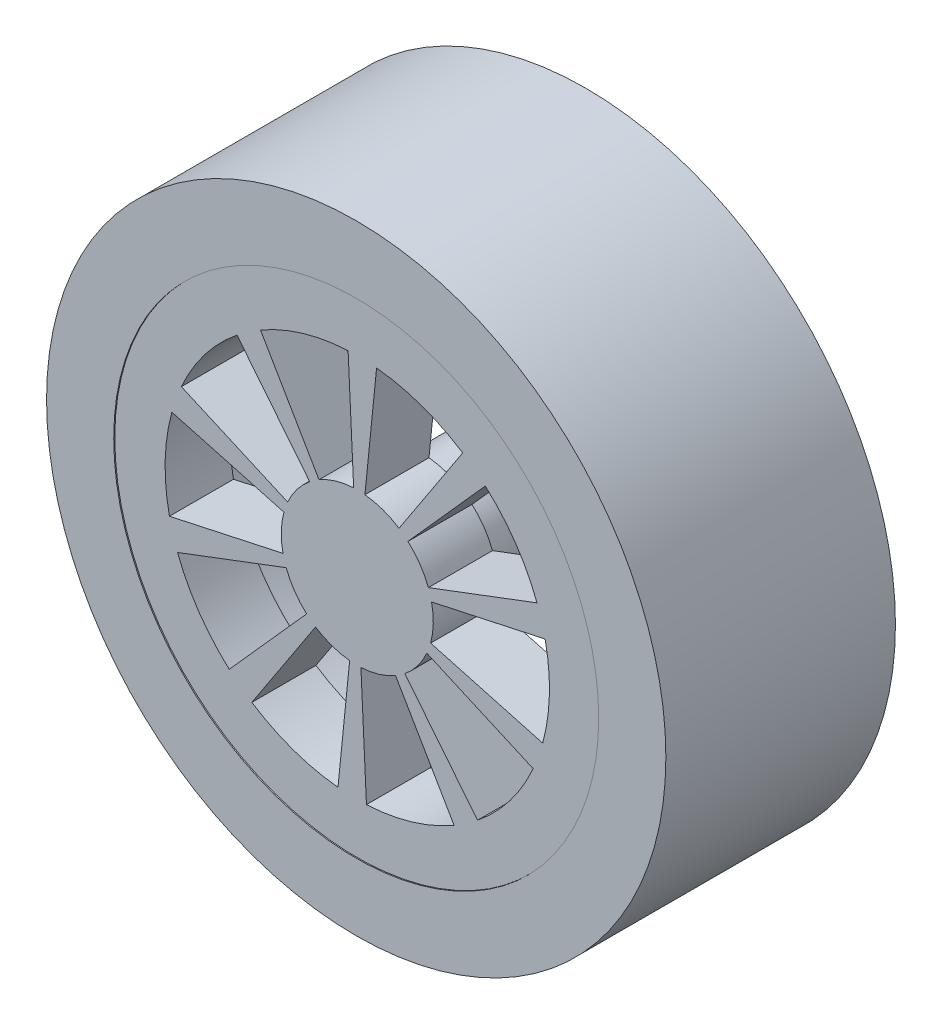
ISO-10303-21;
HEADER;
FILE_DESCRIPTION(('STEP AP214'),'2;1');
FILE_NAME('part.step','',(''),(''),'','','');
FILE_SCHEMA(('AUTOMOTIVE_DESIGN { 1 0 10303 214 1 1 1 1 }'));
ENDSEC;
DATA;
#1=APPLICATION_CONTEXT('core data for automotive mechanical design processes');
#2=APPLICATION_PROTOCOL_DEFINITION('international standard','automotive_design',2000,#1);
#3=PRODUCT_CONTEXT('',#1,'mechanical');
#4=PRODUCT('Part','Part','',(#3));
#5=PRODUCT_RELATED_PRODUCT_CATEGORY('part','',(#4));
#6=PRODUCT_DEFINITION_FORMATION('','',#4);
#7=PRODUCT_DEFINITION_CONTEXT('part definition',#1,'design');
#8=PRODUCT_DEFINITION('design','',#6,#7);
#9=PRODUCT_DEFINITION_SHAPE('','',#8);
#10=(LENGTH_UNIT() NAMED_UNIT(*) SI_UNIT(.MILLI.,.METRE.));
#11=(NAMED_UNIT(*) PLANE_ANGLE_UNIT() SI_UNIT($,.RADIAN.));
#12=(NAMED_UNIT(*) SI_UNIT($,.STERADIAN.) SOLID_ANGLE_UNIT());
#13=UNCERTAINTY_MEASURE_WITH_UNIT(LENGTH_MEASURE(1.E-05),#10,'distance_accuracy_value','');
#14=(GEOMETRIC_REPRESENTATION_CONTEXT(3) GLOBAL_UNCERTAINTY_ASSIGNED_CONTEXT((#13)) GLOBAL_UNIT_ASSIGNED_CONTEXT((#10,
#11,#12)) REPRESENTATION_CONTEXT('',''));
#15=CARTESIAN_POINT('',(0.,0.,0.));
#16=DIRECTION('',(0.,0.,1.));
#17=DIRECTION('',(1.,0.,0.));
#18=AXIS2_PLACEMENT_3D('',#15,#16,#17);
#19=CARTESIAN_POINT('',(0.,0.,10.75));
#20=DIRECTION('',(0.,0.,-1.));
#21=DIRECTION('',(-1.,0.,0.));
#22=AXIS2_PLACEMENT_3D('',#19,#20,#21);
#23=CYLINDRICAL_SURFACE('',#22,11.355);
#24=CARTESIAN_POINT('',(0.,0.,0.));
#25=DIRECTION('',(0.,0.,1.));
#26=DIRECTION('',(1.,0.,0.));
#27=AXIS2_PLACEMENT_3D('',#24,#25,#26);
#28=CIRCLE('',#27,11.355);
#29=CARTESIAN_POINT('',(11.355,0.,0.));
#30=VERTEX_POINT('',#29);
#31=EDGE_CURVE('E722',#30,#30,#28,.T.);
#32=ORIENTED_EDGE('',*,*,#31,.F.);
#33=EDGE_LOOP('',(#32));
#34=FACE_BOUND('',#33,.T.);
#35=CARTESIAN_POINT('',(0.,0.,7.7));
#36=DIRECTION('',(0.,0.,1.));
#37=DIRECTION('',(1.,0.,0.));
#38=AXIS2_PLACEMENT_3D('',#35,#36,#37);
#39=CIRCLE('',#38,11.355);
#40=CARTESIAN_POINT('',(11.355,0.,7.7));
#41=VERTEX_POINT('',#40);
#42=EDGE_CURVE('E718',#41,#41,#39,.T.);
#43=ORIENTED_EDGE('',*,*,#42,.T.);
#44=EDGE_LOOP('',(#43));
#45=FACE_BOUND('',#44,.T.);
#46=ADVANCED_FACE('F51',(#34,#45),#23,.F.);
#47=CARTESIAN_POINT('',(0.,0.,10.75));
#48=DIRECTION('',(0.,0.,1.));
#49=DIRECTION('',(1.,0.,0.));
#50=AXIS2_PLACEMENT_3D('',#47,#48,#49);
#51=PLANE('',#50);
#52=CARTESIAN_POINT('',(0.,0.,10.75));
#53=DIRECTION('',(0.,0.,1.));
#54=DIRECTION('',(1.,0.,0.));
#55=AXIS2_PLACEMENT_3D('',#52,#53,#54);
#56=CIRCLE('',#55,14.5);
#57=CARTESIAN_POINT('',(14.5,0.,10.75));
#58=VERTEX_POINT('',#57);
#59=EDGE_CURVE('E731',#58,#58,#56,.T.);
#60=ORIENTED_EDGE('',*,*,#59,.T.);
#61=EDGE_LOOP('',(#60));
#62=FACE_BOUND('',#61,.T.);
#63=CARTESIAN_POINT('',(0.,0.,10.75));
#64=DIRECTION('',(0.,0.,1.));
#65=DIRECTION('',(1.,0.,0.));
#66=AXIS2_PLACEMENT_3D('',#63,#64,#65);
#67=CIRCLE('',#66,11.355);
#68=CARTESIAN_POINT('',(11.355,0.,10.75));
#69=VERTEX_POINT('',#68);
#70=EDGE_CURVE('E723',#69,#69,#67,.T.);
#71=ORIENTED_EDGE('',*,*,#70,.F.);
#72=EDGE_LOOP('',(#71));
#73=FACE_BOUND('',#72,.T.);
#74=ADVANCED_FACE('F749',(#62,#73),#51,.T.);
#75=CARTESIAN_POINT('',(0.,0.,0.));
#76=DIRECTION('',(0.,0.,1.));
#77=DIRECTION('',(1.,0.,0.));
#78=AXIS2_PLACEMENT_3D('',#75,#76,#77);
#79=PLANE('',#78);
#80=CARTESIAN_POINT('',(0.,0.,0.));
#81=DIRECTION('',(0.,0.,1.));
#82=DIRECTION('',(1.,0.,0.));
#83=AXIS2_PLACEMENT_3D('',#80,#81,#82);
#84=CIRCLE('',#83,14.5);
#85=CARTESIAN_POINT('',(14.5,0.,0.));
#86=VERTEX_POINT('',#85);
#87=EDGE_CURVE('E727',#86,#86,#84,.T.);
#88=ORIENTED_EDGE('',*,*,#87,.F.);
#89=EDGE_LOOP('',(#88));
#90=FACE_BOUND('',#89,.T.);
#91=ORIENTED_EDGE('',*,*,#31,.T.);
#92=EDGE_LOOP('',(#91));
#93=FACE_BOUND('',#92,.T.);
#94=ADVANCED_FACE('F751',(#90,#93),#79,.F.);
#95=CARTESIAN_POINT('',(0.,0.,10.75));
#96=DIRECTION('',(0.,0.,-1.));
#97=DIRECTION('',(-1.,0.,0.));
#98=AXIS2_PLACEMENT_3D('',#95,#96,#97);
#99=CYLINDRICAL_SURFACE('',#98,14.5);
#100=ORIENTED_EDGE('',*,*,#59,.F.);
#101=EDGE_LOOP('',(#100));
#102=FACE_BOUND('',#101,.T.);
#103=ORIENTED_EDGE('',*,*,#87,.T.);
#104=EDGE_LOOP('',(#103));
#105=FACE_BOUND('',#104,.T.);
#106=ADVANCED_FACE('F53',(#102,#105),#99,.T.);
#107=CARTESIAN_POINT('',(0.,0.,10.7));
#108=DIRECTION('',(0.,0.,1.));
#109=DIRECTION('',(1.,0.,0.));
#110=AXIS2_PLACEMENT_3D('',#107,#108,#109);
#111=CIRCLE('',#110,11.355);
#112=CARTESIAN_POINT('',(11.355,0.,10.7));
#113=VERTEX_POINT('',#112);
#114=EDGE_CURVE('E60',#113,#113,#111,.T.);
#115=ORIENTED_EDGE('',*,*,#114,.F.);
#116=EDGE_LOOP('',(#115));
#117=FACE_BOUND('',#116,.T.);
#118=ORIENTED_EDGE('',*,*,#70,.T.);
#119=EDGE_LOOP('',(#118));
#120=FACE_BOUND('',#119,.T.);
#121=ADVANCED_FACE('F742',(#117,#120),#23,.F.);
#122=CARTESIAN_POINT('',(0.,0.,7.7));
#123=DIRECTION('',(0.,0.,1.));
#124=DIRECTION('',(1.,0.,0.));
#125=AXIS2_PLACEMENT_3D('',#122,#123,#124);
#126=PLANE('',#125);
#127=CARTESIAN_POINT('',(0.,0.,7.7));
#128=DIRECTION('',(0.,0.,1.));
#129=DIRECTION('',(1.,0.,0.));
#130=AXIS2_PLACEMENT_3D('',#127,#128,#129);
#131=CIRCLE('',#130,2.715);
#132=CARTESIAN_POINT('',(2.715,0.,7.7));
#133=VERTEX_POINT('',#132);
#134=EDGE_CURVE('E11',#133,#133,#131,.F.);
#135=ORIENTED_EDGE('',*,*,#134,.F.);
#136=EDGE_LOOP('',(#135));
#137=FACE_BOUND('',#136,.T.);
#138=DIRECTION('',(-0.047710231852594,0.998861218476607,0.));
#139=VECTOR('',#138,1.);
#140=CARTESIAN_POINT('',(0.169848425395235,-3.55594593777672,7.7));
#141=LINE('',#140,#139);
#142=CARTESIAN_POINT('',(0.429392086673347,-8.98975096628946,7.7));
#143=VERTEX_POINT('',#142);
#144=CARTESIAN_POINT('',(0.169848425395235,-3.55594593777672,7.7));
#145=VERTEX_POINT('',#144);
#146=EDGE_CURVE('E522',#143,#145,#141,.T.);
#147=ORIENTED_EDGE('',*,*,#146,.F.);
#148=CARTESIAN_POINT('',(0.,0.,7.7));
#149=DIRECTION('',(0.,0.,1.));
#150=DIRECTION('',(1.,0.,0.));
#151=AXIS2_PLACEMENT_3D('',#148,#149,#150);
#152=CIRCLE('',#151,9.);
#153=CARTESIAN_POINT('',(4.53188047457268,-7.77573529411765,7.7));
#154=VERTEX_POINT('',#153);
#155=EDGE_CURVE('E526',#154,#143,#152,.F.);
#156=ORIENTED_EDGE('',*,*,#155,.F.);
#157=DIRECTION('',(0.50354227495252,-0.863970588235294,0.));
#158=VECTOR('',#157,1.);
#159=CARTESIAN_POINT('',(4.53188047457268,-7.77573529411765,7.7));
#160=LINE('',#159,#158);
#161=CARTESIAN_POINT('',(1.79261049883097,-3.07573529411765,7.7));
#162=VERTEX_POINT('',#161);
#163=EDGE_CURVE('E494',#162,#154,#160,.T.);
#164=ORIENTED_EDGE('',*,*,#163,.F.);
#165=CARTESIAN_POINT('',(0.,0.,7.7));
#166=DIRECTION('',(0.,0.,1.));
#167=DIRECTION('',(1.,0.,0.));
#168=AXIS2_PLACEMENT_3D('',#165,#166,#167);
#169=CIRCLE('',#168,3.56);
#170=EDGE_CURVE('E519',#145,#162,#169,.T.);
#171=ORIENTED_EDGE('',*,*,#170,.F.);
#172=EDGE_LOOP('',(#147,#156,#164,#171));
#173=FACE_BOUND('',#172,.T.);
#174=DIRECTION('',(0.548517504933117,0.836139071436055,0.));
#175=VECTOR('',#174,1.);
#176=CARTESIAN_POINT('',(-1.9527223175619,-2.97665509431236,7.7));
#177=LINE('',#176,#175);
#178=CARTESIAN_POINT('',(-4.93665754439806,-7.52525164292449,7.7));
#179=VERTEX_POINT('',#178);
#180=CARTESIAN_POINT('',(-1.9527223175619,-2.97665509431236,7.7));
#181=VERTEX_POINT('',#180);
#182=EDGE_CURVE('E482',#179,#181,#177,.T.);
#183=ORIENTED_EDGE('',*,*,#182,.F.);
#184=CARTESIAN_POINT('',(0.,0.,7.7));
#185=DIRECTION('',(0.,0.,1.));
#186=DIRECTION('',(1.,0.,0.));
#187=AXIS2_PLACEMENT_3D('',#184,#185,#186);
#188=CIRCLE('',#187,9.);
#189=CARTESIAN_POINT('',(-0.904094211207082,-8.9544745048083,7.7));
#190=VERTEX_POINT('',#189);
#191=EDGE_CURVE('E486',#190,#179,#188,.F.);
#192=ORIENTED_EDGE('',*,*,#191,.F.);
#193=DIRECTION('',(-0.100454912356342,-0.994941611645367,0.));
#194=VECTOR('',#193,1.);
#195=CARTESIAN_POINT('',(-0.904094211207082,-8.9544745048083,7.7));
#196=LINE('',#195,#194);
#197=CARTESIAN_POINT('',(-0.357619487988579,-3.54199213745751,7.7));
#198=VERTEX_POINT('',#197);
#199=EDGE_CURVE('E489',#198,#190,#196,.T.);
#200=ORIENTED_EDGE('',*,*,#199,.F.);
#201=CARTESIAN_POINT('',(0.,0.,7.7));
#202=DIRECTION('',(0.,0.,1.));
#203=DIRECTION('',(1.,0.,0.));
#204=AXIS2_PLACEMENT_3D('',#201,#202,#203);
#205=CIRCLE('',#204,3.56);
#206=EDGE_CURVE('E479',#181,#198,#205,.T.);
#207=ORIENTED_EDGE('',*,*,#206,.F.);
#208=EDGE_LOOP('',(#183,#192,#200,#207));
#209=FACE_BOUND('',#208,.T.);
#210=DIRECTION('',(0.964716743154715,-0.263289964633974,0.));
#211=VECTOR('',#210,1.);
#212=CARTESIAN_POINT('',(-3.43439160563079,0.937312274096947,7.7));
#213=LINE('',#212,#211);
#214=CARTESIAN_POINT('',(-8.68245068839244,2.36960968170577,7.7));
#215=VERTEX_POINT('',#214);
#216=CARTESIAN_POINT('',(-3.43439160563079,0.937312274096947,7.7));
#217=VERTEX_POINT('',#216);
#218=EDGE_CURVE('E600',#215,#217,#213,.T.);
#219=ORIENTED_EDGE('',*,*,#218,.F.);
#220=CARTESIAN_POINT('',(0.,0.,7.7));
#221=DIRECTION('',(0.,0.,1.));
#222=DIRECTION('',(1.,0.,0.));
#223=AXIS2_PLACEMENT_3D('',#220,#221,#222);
#224=CIRCLE('',#223,9.);
#225=CARTESIAN_POINT('',(-8.79559180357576,-1.90724010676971,7.7));
#226=VERTEX_POINT('',#225);
#227=EDGE_CURVE('E604',#226,#215,#224,.F.);
#228=ORIENTED_EDGE('',*,*,#227,.F.);
#229=DIRECTION('',(-0.977287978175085,-0.211915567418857,0.));
#230=VECTOR('',#229,1.);
#231=CARTESIAN_POINT('',(-8.79559180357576,-1.90724010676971,7.7));
#232=LINE('',#231,#230);
#233=CARTESIAN_POINT('',(-3.4791452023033,-0.754419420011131,7.7));
#234=VERTEX_POINT('',#233);
#235=EDGE_CURVE('E607',#234,#226,#232,.T.);
#236=ORIENTED_EDGE('',*,*,#235,.F.);
#237=CARTESIAN_POINT('',(0.,0.,7.7));
#238=DIRECTION('',(0.,0.,1.));
#239=DIRECTION('',(1.,0.,0.));
#240=AXIS2_PLACEMENT_3D('',#237,#238,#239);
#241=CIRCLE('',#240,3.56);
#242=EDGE_CURVE('E596',#217,#234,#241,.T.);
#243=ORIENTED_EDGE('',*,*,#242,.F.);
#244=EDGE_LOOP('',(#219,#228,#236,#243));
#245=FACE_BOUND('',#244,.T.);
#246=DIRECTION('',(0.935230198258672,0.354040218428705,0.));
#247=VECTOR('',#246,1.);
#248=CARTESIAN_POINT('',(-3.32941950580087,-1.26038317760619,7.7));
#249=LINE('',#248,#247);
#250=CARTESIAN_POINT('',(-8.41707178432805,-3.18636196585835,7.7));
#251=VERTEX_POINT('',#250);
#252=CARTESIAN_POINT('',(-3.32941950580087,-1.26038317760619,7.7));
#253=VERTEX_POINT('',#252);
#254=EDGE_CURVE('E559',#251,#253,#249,.T.);
#255=ORIENTED_EDGE('',*,*,#254,.F.);
#256=CARTESIAN_POINT('',(0.,0.,7.7));
#257=DIRECTION('',(0.,0.,1.));
#258=DIRECTION('',(1.,0.,0.));
#259=AXIS2_PLACEMENT_3D('',#256,#257,#258);
#260=CIRCLE('',#259,9.);
#261=CARTESIAN_POINT('',(-5.99473563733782,-6.71290880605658,7.7));
#262=VERTEX_POINT('',#261);
#263=EDGE_CURVE('E563',#262,#251,#260,.F.);
#264=ORIENTED_EDGE('',*,*,#263,.F.);
#265=DIRECTION('',(-0.66608173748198,-0.745878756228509,0.));
#266=VECTOR('',#265,1.);
#267=CARTESIAN_POINT('',(-5.99473563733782,-6.71290880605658,7.7));
#268=LINE('',#267,#266);
#269=CARTESIAN_POINT('',(-2.37125098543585,-2.65532837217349,7.7));
#270=VERTEX_POINT('',#269);
#271=EDGE_CURVE('E566',#270,#262,#268,.T.);
#272=ORIENTED_EDGE('',*,*,#271,.F.);
#273=CARTESIAN_POINT('',(0.,0.,7.7));
#274=DIRECTION('',(0.,0.,1.));
#275=DIRECTION('',(1.,0.,0.));
#276=AXIS2_PLACEMENT_3D('',#273,#274,#275);
#277=CIRCLE('',#276,3.56);
#278=EDGE_CURVE('E555',#253,#270,#277,.T.);
#279=ORIENTED_EDGE('',*,*,#278,.F.);
#280=EDGE_LOOP('',(#255,#264,#272,#279));
#281=FACE_BOUND('',#280,.T.);
#282=DIRECTION('',(-0.935230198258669,-0.354040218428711,0.));
#283=VECTOR('',#282,1.);
#284=CARTESIAN_POINT('',(3.32941950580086,1.26038317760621,7.7));
#285=LINE('',#284,#283);
#286=CARTESIAN_POINT('',(8.41707178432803,3.1863619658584,7.7));
#287=VERTEX_POINT('',#286);
#288=CARTESIAN_POINT('',(3.32941950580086,1.26038317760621,7.7));
#289=VERTEX_POINT('',#288);
#290=EDGE_CURVE('E360',#287,#289,#285,.T.);
#291=ORIENTED_EDGE('',*,*,#290,.F.);
#292=CARTESIAN_POINT('',(0.,0.,7.7));
#293=DIRECTION('',(0.,0.,1.));
#294=DIRECTION('',(1.,0.,0.));
#295=AXIS2_PLACEMENT_3D('',#292,#293,#294);
#296=CIRCLE('',#295,9.);
#297=CARTESIAN_POINT('',(5.99473563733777,6.71290880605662,7.7));
#298=VERTEX_POINT('',#297);
#299=EDGE_CURVE('E364',#298,#287,#296,.F.);
#300=ORIENTED_EDGE('',*,*,#299,.F.);
#301=DIRECTION('',(0.666081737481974,0.745878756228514,0.));
#302=VECTOR('',#301,1.);
#303=CARTESIAN_POINT('',(5.99473563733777,6.71290880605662,7.7));
#304=LINE('',#303,#302);
#305=CARTESIAN_POINT('',(2.37125098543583,2.65532837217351,7.7));
#306=VERTEX_POINT('',#305);
#307=EDGE_CURVE('E367',#306,#298,#304,.T.);
#308=ORIENTED_EDGE('',*,*,#307,.F.);
#309=CARTESIAN_POINT('',(0.,0.,7.7));
#310=DIRECTION('',(0.,0.,1.));
#311=DIRECTION('',(1.,0.,0.));
#312=AXIS2_PLACEMENT_3D('',#309,#310,#311);
#313=CIRCLE('',#312,3.56);
#314=EDGE_CURVE('E356',#289,#306,#313,.T.);
#315=ORIENTED_EDGE('',*,*,#314,.F.);
#316=EDGE_LOOP('',(#291,#300,#308,#315));
#317=FACE_BOUND('',#316,.T.);
#318=DIRECTION('',(-0.548517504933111,-0.836139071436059,0.));
#319=VECTOR('',#318,1.);
#320=CARTESIAN_POINT('',(1.95272231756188,2.97665509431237,7.7));
#321=LINE('',#320,#319);
#322=CARTESIAN_POINT('',(4.936657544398,7.52525164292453,7.7));
#323=VERTEX_POINT('',#322);
#324=CARTESIAN_POINT('',(1.95272231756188,2.97665509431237,7.7));
#325=VERTEX_POINT('',#324);
#326=EDGE_CURVE('E964',#323,#325,#321,.T.);
#327=ORIENTED_EDGE('',*,*,#326,.F.);
#328=CARTESIAN_POINT('',(0.,0.,7.7));
#329=DIRECTION('',(0.,0.,1.));
#330=DIRECTION('',(1.,0.,0.));
#331=AXIS2_PLACEMENT_3D('',#328,#329,#330);
#332=CIRCLE('',#331,9.);
#333=CARTESIAN_POINT('',(0.904094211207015,8.95447450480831,7.7));
#334=VERTEX_POINT('',#333);
#335=EDGE_CURVE('E355',#334,#323,#332,.F.);
#336=ORIENTED_EDGE('',*,*,#335,.F.);
#337=DIRECTION('',(0.100454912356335,0.994941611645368,0.));
#338=VECTOR('',#337,1.);
#339=CARTESIAN_POINT('',(0.904094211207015,8.95447450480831,7.7));
#340=LINE('',#339,#338);
#341=CARTESIAN_POINT('',(0.357619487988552,3.54199213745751,7.7));
#342=VERTEX_POINT('',#341);
#343=EDGE_CURVE('E351',#342,#334,#340,.T.);
#344=ORIENTED_EDGE('',*,*,#343,.F.);
#345=CARTESIAN_POINT('',(0.,0.,7.7));
#346=DIRECTION('',(0.,0.,1.));
#347=DIRECTION('',(1.,0.,0.));
#348=AXIS2_PLACEMENT_3D('',#345,#346,#347);
#349=CIRCLE('',#348,3.56);
#350=EDGE_CURVE('E317',#325,#342,#349,.T.);
#351=ORIENTED_EDGE('',*,*,#350,.F.);
#352=EDGE_LOOP('',(#327,#336,#344,#351));
#353=FACE_BOUND('',#352,.T.);
#354=DIRECTION('',(-0.625714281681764,0.780052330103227,0.));
#355=VECTOR('',#354,1.);
#356=CARTESIAN_POINT('',(2.22754284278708,-2.77698629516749,7.7));
#357=LINE('',#356,#355);
#358=CARTESIAN_POINT('',(5.63142853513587,-7.02047097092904,7.7));
#359=VERTEX_POINT('',#358);
#360=CARTESIAN_POINT('',(2.22754284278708,-2.77698629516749,7.7));
#361=VERTEX_POINT('',#360);
#362=EDGE_CURVE('E442',#359,#361,#357,.T.);
#363=ORIENTED_EDGE('',*,*,#362,.F.);
#364=CARTESIAN_POINT('',(0.,0.,7.7));
#365=DIRECTION('',(0.,0.,1.));
#366=DIRECTION('',(1.,0.,0.));
#367=AXIS2_PLACEMENT_3D('',#364,#365,#366);
#368=CIRCLE('',#367,9.);
#369=CARTESIAN_POINT('',(8.23683085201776,-3.62692948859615,7.7));
#370=VERTEX_POINT('',#369);
#371=EDGE_CURVE('E446',#370,#359,#368,.F.);
#372=ORIENTED_EDGE('',*,*,#371,.F.);
#373=DIRECTION('',(0.915203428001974,-0.402992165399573,0.));
#374=VECTOR('',#373,1.);
#375=CARTESIAN_POINT('',(8.23683085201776,-3.62692948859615,7.7));
#376=LINE('',#375,#374);
#377=CARTESIAN_POINT('',(3.25812420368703,-1.43465210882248,7.7));
#378=VERTEX_POINT('',#377);
#379=EDGE_CURVE('E449',#378,#370,#376,.T.);
#380=ORIENTED_EDGE('',*,*,#379,.F.);
#381=CARTESIAN_POINT('',(0.,0.,7.7));
#382=DIRECTION('',(0.,0.,1.));
#383=DIRECTION('',(1.,0.,0.));
#384=AXIS2_PLACEMENT_3D('',#381,#382,#383);
#385=CIRCLE('',#384,3.56);
#386=EDGE_CURVE('E438',#361,#378,#385,.T.);
#387=ORIENTED_EDGE('',*,*,#386,.F.);
#388=EDGE_LOOP('',(#363,#372,#380,#387));
#389=FACE_BOUND('',#388,.T.);
#390=DIRECTION('',(-0.964716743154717,0.263289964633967,0.));
#391=VECTOR('',#390,1.);
#392=CARTESIAN_POINT('',(3.43439160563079,-0.937312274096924,7.7));
#393=LINE('',#392,#391);
#394=CARTESIAN_POINT('',(8.68245068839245,-2.36960968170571,7.7));
#395=VERTEX_POINT('',#394);
#396=CARTESIAN_POINT('',(3.43439160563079,-0.937312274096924,7.7));
#397=VERTEX_POINT('',#396);
#398=EDGE_CURVE('E401',#395,#397,#393,.T.);
#399=ORIENTED_EDGE('',*,*,#398,.F.);
#400=CARTESIAN_POINT('',(0.,0.,7.7));
#401=DIRECTION('',(0.,0.,1.));
#402=DIRECTION('',(1.,0.,0.));
#403=AXIS2_PLACEMENT_3D('',#400,#401,#402);
#404=CIRCLE('',#403,9.);
#405=CARTESIAN_POINT('',(8.79559180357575,1.90724010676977,7.7));
#406=VERTEX_POINT('',#405);
#407=EDGE_CURVE('E405',#406,#395,#404,.F.);
#408=ORIENTED_EDGE('',*,*,#407,.F.);
#409=DIRECTION('',(0.977287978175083,0.211915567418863,0.));
#410=VECTOR('',#409,1.);
#411=CARTESIAN_POINT('',(8.79559180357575,1.90724010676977,7.7));
#412=LINE('',#411,#410);
#413=CARTESIAN_POINT('',(3.4791452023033,0.754419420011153,7.7));
#414=VERTEX_POINT('',#413);
#415=EDGE_CURVE('E408',#414,#406,#412,.T.);
#416=ORIENTED_EDGE('',*,*,#415,.F.);
#417=CARTESIAN_POINT('',(0.,0.,7.7));
#418=DIRECTION('',(0.,0.,1.));
#419=DIRECTION('',(1.,0.,0.));
#420=AXIS2_PLACEMENT_3D('',#417,#418,#419);
#421=CIRCLE('',#420,3.56);
#422=EDGE_CURVE('E397',#397,#414,#421,.T.);
#423=ORIENTED_EDGE('',*,*,#422,.F.);
#424=EDGE_LOOP('',(#399,#408,#416,#423));
#425=FACE_BOUND('',#424,.T.);
#426=DIRECTION('',(0.625714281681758,-0.780052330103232,0.));
#427=VECTOR('',#426,1.);
#428=CARTESIAN_POINT('',(-2.22754284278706,2.77698629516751,7.7));
#429=LINE('',#428,#427);
#430=CARTESIAN_POINT('',(-5.63142853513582,7.02047097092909,7.7));
#431=VERTEX_POINT('',#430);
#432=CARTESIAN_POINT('',(-2.22754284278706,2.77698629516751,7.7));
#433=VERTEX_POINT('',#432);
#434=EDGE_CURVE('E641',#431,#433,#429,.T.);
#435=ORIENTED_EDGE('',*,*,#434,.F.);
#436=CARTESIAN_POINT('',(0.,0.,7.7));
#437=DIRECTION('',(0.,0.,1.));
#438=DIRECTION('',(1.,0.,0.));
#439=AXIS2_PLACEMENT_3D('',#436,#437,#438);
#440=CIRCLE('',#439,9.);
#441=CARTESIAN_POINT('',(-8.23683085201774,3.62692948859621,7.7));
#442=VERTEX_POINT('',#441);
#443=EDGE_CURVE('E645',#442,#431,#440,.F.);
#444=ORIENTED_EDGE('',*,*,#443,.F.);
#445=DIRECTION('',(-0.915203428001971,0.402992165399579,0.));
#446=VECTOR('',#445,1.);
#447=CARTESIAN_POINT('',(-8.23683085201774,3.62692948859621,7.7));
#448=LINE('',#447,#446);
#449=CARTESIAN_POINT('',(-3.25812420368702,1.4346521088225,7.7));
#450=VERTEX_POINT('',#449);
#451=EDGE_CURVE('E648',#450,#442,#448,.T.);
#452=ORIENTED_EDGE('',*,*,#451,.F.);
#453=CARTESIAN_POINT('',(0.,0.,7.7));
#454=DIRECTION('',(0.,0.,1.));
#455=DIRECTION('',(1.,0.,0.));
#456=AXIS2_PLACEMENT_3D('',#453,#454,#455);
#457=CIRCLE('',#456,3.56);
#458=EDGE_CURVE('E637',#433,#450,#457,.T.);
#459=ORIENTED_EDGE('',*,*,#458,.F.);
#460=EDGE_LOOP('',(#435,#444,#452,#459));
#461=FACE_BOUND('',#460,.T.);
#462=DIRECTION('',(0.047710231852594,-0.998861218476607,0.));
#463=VECTOR('',#462,1.);
#464=CARTESIAN_POINT('',(-0.169848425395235,3.55594593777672,7.7));
#465=LINE('',#464,#463);
#466=CARTESIAN_POINT('',(-0.429392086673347,8.98975096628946,7.7));
#467=VERTEX_POINT('',#466);
#468=CARTESIAN_POINT('',(-0.169848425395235,3.55594593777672,7.7));
#469=VERTEX_POINT('',#468);
#470=EDGE_CURVE('E682',#467,#469,#465,.T.);
#471=ORIENTED_EDGE('',*,*,#470,.F.);
#472=CARTESIAN_POINT('',(0.,0.,7.7));
#473=DIRECTION('',(0.,0.,1.));
#474=DIRECTION('',(1.,0.,0.));
#475=AXIS2_PLACEMENT_3D('',#472,#473,#474);
#476=CIRCLE('',#475,9.);
#477=CARTESIAN_POINT('',(-4.53188047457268,7.77573529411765,7.7));
#478=VERTEX_POINT('',#477);
#479=EDGE_CURVE('E686',#478,#467,#476,.F.);
#480=ORIENTED_EDGE('',*,*,#479,.F.);
#481=DIRECTION('',(-0.50354227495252,0.863970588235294,0.));
#482=VECTOR('',#481,1.);
#483=CARTESIAN_POINT('',(-4.53188047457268,7.77573529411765,7.7));
#484=LINE('',#483,#482);
#485=CARTESIAN_POINT('',(-1.79261049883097,3.07573529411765,7.7));
#486=VERTEX_POINT('',#485);
#487=EDGE_CURVE('E689',#486,#478,#484,.T.);
#488=ORIENTED_EDGE('',*,*,#487,.F.);
#489=CARTESIAN_POINT('',(0.,0.,7.7));
#490=DIRECTION('',(0.,0.,1.));
#491=DIRECTION('',(1.,0.,0.));
#492=AXIS2_PLACEMENT_3D('',#489,#490,#491);
#493=CIRCLE('',#492,3.56);
#494=EDGE_CURVE('E678',#469,#486,#493,.T.);
#495=ORIENTED_EDGE('',*,*,#494,.F.);
#496=EDGE_LOOP('',(#471,#480,#488,#495));
#497=FACE_BOUND('',#496,.T.);
#498=ORIENTED_EDGE('',*,*,#42,.F.);
#499=EDGE_LOOP('',(#498));
#500=FACE_BOUND('',#499,.T.);
#501=ADVANCED_FACE('F745',(#137,#173,#209,#245,#281,#317,#353,#389,#425,#461,#497,#500),#126,.F.);
#502=CARTESIAN_POINT('',(0.,0.,10.7));
#503=DIRECTION('',(0.,0.,1.));
#504=DIRECTION('',(1.,0.,0.));
#505=AXIS2_PLACEMENT_3D('',#502,#503,#504);
#506=PLANE('',#505);
#507=CARTESIAN_POINT('',(0.,0.,10.7));
#508=DIRECTION('',(0.,0.,1.));
#509=DIRECTION('',(-1.,0.,0.));
#510=AXIS2_PLACEMENT_3D('',#507,#508,#509);
#511=CIRCLE('',#510,9.);
#512=CARTESIAN_POINT('',(0.429392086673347,-8.98975096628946,10.7));
#513=VERTEX_POINT('',#512);
#514=CARTESIAN_POINT('',(4.53188047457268,-7.77573529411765,10.7));
#515=VERTEX_POINT('',#514);
#516=EDGE_CURVE('E478',#513,#515,#511,.T.);
#517=ORIENTED_EDGE('',*,*,#516,.F.);
#518=DIRECTION('',(0.047710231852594,-0.998861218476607,0.));
#519=VECTOR('',#518,1.);
#520=CARTESIAN_POINT('',(0.169848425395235,-3.55594593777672,10.7));
#521=LINE('',#520,#519);
#522=CARTESIAN_POINT('',(0.169848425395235,-3.55594593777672,10.7));
#523=VERTEX_POINT('',#522);
#524=EDGE_CURVE('E538',#523,#513,#521,.T.);
#525=ORIENTED_EDGE('',*,*,#524,.F.);
#526=CARTESIAN_POINT('',(0.,0.,10.7));
#527=DIRECTION('',(0.,0.,-1.));
#528=DIRECTION('',(1.,0.,0.));
#529=AXIS2_PLACEMENT_3D('',#526,#527,#528);
#530=CIRCLE('',#529,3.56);
#531=CARTESIAN_POINT('',(1.79261049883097,-3.07573529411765,10.7));
#532=VERTEX_POINT('',#531);
#533=EDGE_CURVE('E534',#532,#523,#530,.T.);
#534=ORIENTED_EDGE('',*,*,#533,.F.);
#535=DIRECTION('',(-0.50354227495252,0.863970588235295,0.));
#536=VECTOR('',#535,1.);
#537=CARTESIAN_POINT('',(4.53188047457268,-7.77573529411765,10.7));
#538=LINE('',#537,#536);
#539=EDGE_CURVE('E531',#515,#532,#538,.T.);
#540=ORIENTED_EDGE('',*,*,#539,.F.);
#541=EDGE_LOOP('',(#517,#525,#534,#540));
#542=FACE_BOUND('',#541,.T.);
#543=CARTESIAN_POINT('',(0.,0.,10.7));
#544=DIRECTION('',(0.,0.,1.));
#545=DIRECTION('',(-0.809016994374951,0.587785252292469,0.));
#546=AXIS2_PLACEMENT_3D('',#543,#544,#545);
#547=CIRCLE('',#546,9.);
#548=CARTESIAN_POINT('',(-4.93665754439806,-7.52525164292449,10.7));
#549=VERTEX_POINT('',#548);
#550=CARTESIAN_POINT('',(-0.904094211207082,-8.9544745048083,10.7));
#551=VERTEX_POINT('',#550);
#552=EDGE_CURVE('E490',#549,#551,#547,.T.);
#553=ORIENTED_EDGE('',*,*,#552,.F.);
#554=DIRECTION('',(-0.548517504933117,-0.836139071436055,0.));
#555=VECTOR('',#554,1.);
#556=CARTESIAN_POINT('',(-1.9527223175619,-2.97665509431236,10.7));
#557=LINE('',#556,#555);
#558=CARTESIAN_POINT('',(-1.9527223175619,-2.97665509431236,10.7));
#559=VERTEX_POINT('',#558);
#560=EDGE_CURVE('E501',#559,#549,#557,.T.);
#561=ORIENTED_EDGE('',*,*,#560,.F.);
#562=CARTESIAN_POINT('',(0.,0.,10.7));
#563=DIRECTION('',(0.,0.,-1.));
#564=DIRECTION('',(0.809016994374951,-0.587785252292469,0.));
#565=AXIS2_PLACEMENT_3D('',#562,#563,#564);
#566=CIRCLE('',#565,3.56);
#567=CARTESIAN_POINT('',(-0.357619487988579,-3.54199213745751,10.7));
#568=VERTEX_POINT('',#567);
#569=EDGE_CURVE('E497',#568,#559,#566,.T.);
#570=ORIENTED_EDGE('',*,*,#569,.F.);
#571=DIRECTION('',(0.100454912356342,0.994941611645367,0.));
#572=VECTOR('',#571,1.);
#573=CARTESIAN_POINT('',(-0.904094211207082,-8.9544745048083,10.7));
#574=LINE('',#573,#572);
#575=EDGE_CURVE('E493',#551,#568,#574,.T.);
#576=ORIENTED_EDGE('',*,*,#575,.F.);
#577=EDGE_LOOP('',(#553,#561,#570,#576));
#578=FACE_BOUND('',#577,.T.);
#579=CARTESIAN_POINT('',(0.,0.,10.7));
#580=DIRECTION('',(0.,0.,1.));
#581=DIRECTION('',(0.309016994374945,0.951056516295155,0.));
#582=AXIS2_PLACEMENT_3D('',#579,#580,#581);
#583=CIRCLE('',#582,9.);
#584=CARTESIAN_POINT('',(-8.68245068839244,2.36960968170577,10.7));
#585=VERTEX_POINT('',#584);
#586=CARTESIAN_POINT('',(-8.79559180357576,-1.90724010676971,10.7));
#587=VERTEX_POINT('',#586);
#588=EDGE_CURVE('E595',#585,#587,#583,.T.);
#589=ORIENTED_EDGE('',*,*,#588,.F.);
#590=DIRECTION('',(-0.964716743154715,0.263289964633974,0.));
#591=VECTOR('',#590,1.);
#592=CARTESIAN_POINT('',(-3.43439160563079,0.937312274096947,10.7));
#593=LINE('',#592,#591);
#594=CARTESIAN_POINT('',(-3.43439160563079,0.937312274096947,10.7));
#595=VERTEX_POINT('',#594);
#596=EDGE_CURVE('E618',#595,#585,#593,.T.);
#597=ORIENTED_EDGE('',*,*,#596,.F.);
#598=CARTESIAN_POINT('',(0.,0.,10.7));
#599=DIRECTION('',(0.,0.,-1.));
#600=DIRECTION('',(-0.309016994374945,-0.951056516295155,0.));
#601=AXIS2_PLACEMENT_3D('',#598,#599,#600);
#602=CIRCLE('',#601,3.56);
#603=CARTESIAN_POINT('',(-3.4791452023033,-0.75441942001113,10.7));
#604=VERTEX_POINT('',#603);
#605=EDGE_CURVE('E614',#604,#595,#602,.T.);
#606=ORIENTED_EDGE('',*,*,#605,.F.);
#607=DIRECTION('',(0.977287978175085,0.211915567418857,0.));
#608=VECTOR('',#607,1.);
#609=CARTESIAN_POINT('',(-8.79559180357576,-1.90724010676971,10.7));
#610=LINE('',#609,#608);
#611=EDGE_CURVE('E610',#587,#604,#610,.T.);
#612=ORIENTED_EDGE('',*,*,#611,.F.);
#613=EDGE_LOOP('',(#589,#597,#606,#612));
#614=FACE_BOUND('',#613,.T.);
#615=CARTESIAN_POINT('',(0.,0.,10.7));
#616=DIRECTION('',(0.,0.,1.));
#617=DIRECTION('',(-0.309016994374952,0.951056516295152,0.));
#618=AXIS2_PLACEMENT_3D('',#615,#616,#617);
#619=CIRCLE('',#618,9.);
#620=CARTESIAN_POINT('',(-8.41707178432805,-3.18636196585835,10.7));
#621=VERTEX_POINT('',#620);
#622=CARTESIAN_POINT('',(-5.99473563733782,-6.71290880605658,10.7));
#623=VERTEX_POINT('',#622);
#624=EDGE_CURVE('E518',#621,#623,#619,.T.);
#625=ORIENTED_EDGE('',*,*,#624,.F.);
#626=DIRECTION('',(-0.935230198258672,-0.354040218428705,0.));
#627=VECTOR('',#626,1.);
#628=CARTESIAN_POINT('',(-3.32941950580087,-1.26038317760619,10.7));
#629=LINE('',#628,#627);
#630=CARTESIAN_POINT('',(-3.32941950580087,-1.26038317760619,10.7));
#631=VERTEX_POINT('',#630);
#632=EDGE_CURVE('E577',#631,#621,#629,.T.);
#633=ORIENTED_EDGE('',*,*,#632,.F.);
#634=CARTESIAN_POINT('',(0.,0.,10.7));
#635=DIRECTION('',(0.,0.,-1.));
#636=DIRECTION('',(0.309016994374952,-0.951056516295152,0.));
#637=AXIS2_PLACEMENT_3D('',#634,#635,#636);
#638=CIRCLE('',#637,3.56);
#639=CARTESIAN_POINT('',(-2.37125098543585,-2.65532837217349,10.7));
#640=VERTEX_POINT('',#639);
#641=EDGE_CURVE('E573',#640,#631,#638,.T.);
#642=ORIENTED_EDGE('',*,*,#641,.F.);
#643=DIRECTION('',(0.66608173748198,0.745878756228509,0.));
#644=VECTOR('',#643,1.);
#645=CARTESIAN_POINT('',(-5.99473563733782,-6.71290880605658,10.7));
#646=LINE('',#645,#644);
#647=EDGE_CURVE('E569',#623,#640,#646,.T.);
#648=ORIENTED_EDGE('',*,*,#647,.F.);
#649=EDGE_LOOP('',(#625,#633,#642,#648));
#650=FACE_BOUND('',#649,.T.);
#651=CARTESIAN_POINT('',(0.,0.,10.7));
#652=DIRECTION('',(0.,0.,1.));
#653=DIRECTION('',(0.309016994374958,-0.95105651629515,0.));
#654=AXIS2_PLACEMENT_3D('',#651,#652,#653);
#655=CIRCLE('',#654,9.);
#656=CARTESIAN_POINT('',(8.41707178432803,3.1863619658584,10.7));
#657=VERTEX_POINT('',#656);
#658=CARTESIAN_POINT('',(5.99473563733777,6.71290880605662,10.7));
#659=VERTEX_POINT('',#658);
#660=EDGE_CURVE('E354',#657,#659,#655,.T.);
#661=ORIENTED_EDGE('',*,*,#660,.F.);
#662=DIRECTION('',(0.935230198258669,0.354040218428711,0.));
#663=VECTOR('',#662,1.);
#664=CARTESIAN_POINT('',(3.32941950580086,1.26038317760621,10.7));
#665=LINE('',#664,#663);
#666=CARTESIAN_POINT('',(3.32941950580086,1.26038317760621,10.7));
#667=VERTEX_POINT('',#666);
#668=EDGE_CURVE('E378',#667,#657,#665,.T.);
#669=ORIENTED_EDGE('',*,*,#668,.F.);
#670=CARTESIAN_POINT('',(0.,0.,10.7));
#671=DIRECTION('',(0.,0.,-1.));
#672=DIRECTION('',(-0.309016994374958,0.95105651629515,0.));
#673=AXIS2_PLACEMENT_3D('',#670,#671,#672);
#674=CIRCLE('',#673,3.56);
#675=CARTESIAN_POINT('',(2.37125098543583,2.65532837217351,10.7));
#676=VERTEX_POINT('',#675);
#677=EDGE_CURVE('E374',#676,#667,#674,.T.);
#678=ORIENTED_EDGE('',*,*,#677,.F.);
#679=DIRECTION('',(-0.666081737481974,-0.745878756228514,0.));
#680=VECTOR('',#679,1.);
#681=CARTESIAN_POINT('',(5.99473563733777,6.71290880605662,10.7));
#682=LINE('',#681,#680);
#683=EDGE_CURVE('E370',#659,#676,#682,.T.);
#684=ORIENTED_EDGE('',*,*,#683,.F.);
#685=EDGE_LOOP('',(#661,#669,#678,#684));
#686=FACE_BOUND('',#685,.T.);
#687=CARTESIAN_POINT('',(0.,0.,10.7));
#688=DIRECTION('',(0.,0.,1.));
#689=DIRECTION('',(0.809016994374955,-0.587785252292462,0.));
#690=AXIS2_PLACEMENT_3D('',#687,#688,#689);
#691=CIRCLE('',#690,9.);
#692=CARTESIAN_POINT('',(4.936657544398,7.52525164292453,10.7));
#693=VERTEX_POINT('',#692);
#694=CARTESIAN_POINT('',(0.904094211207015,8.95447450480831,10.7));
#695=VERTEX_POINT('',#694);
#696=EDGE_CURVE('E332',#693,#695,#691,.T.);
#697=ORIENTED_EDGE('',*,*,#696,.F.);
#698=DIRECTION('',(0.548517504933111,0.836139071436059,0.));
#699=VECTOR('',#698,1.);
#700=CARTESIAN_POINT('',(1.95272231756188,2.97665509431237,10.7));
#701=LINE('',#700,#699);
#702=CARTESIAN_POINT('',(1.95272231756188,2.97665509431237,10.7));
#703=VERTEX_POINT('',#702);
#704=EDGE_CURVE('E337',#703,#693,#701,.T.);
#705=ORIENTED_EDGE('',*,*,#704,.F.);
#706=CARTESIAN_POINT('',(0.,0.,10.7));
#707=DIRECTION('',(0.,0.,-1.));
#708=DIRECTION('',(-0.809016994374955,0.587785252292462,0.));
#709=AXIS2_PLACEMENT_3D('',#706,#707,#708);
#710=CIRCLE('',#709,3.56);
#711=CARTESIAN_POINT('',(0.357619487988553,3.54199213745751,10.7));
#712=VERTEX_POINT('',#711);
#713=EDGE_CURVE('E314',#712,#703,#710,.T.);
#714=ORIENTED_EDGE('',*,*,#713,.F.);
#715=DIRECTION('',(-0.100454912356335,-0.994941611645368,0.));
#716=VECTOR('',#715,1.);
#717=CARTESIAN_POINT('',(0.904094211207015,8.95447450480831,10.7));
#718=LINE('',#717,#716);
#719=EDGE_CURVE('E326',#695,#712,#718,.T.);
#720=ORIENTED_EDGE('',*,*,#719,.F.);
#721=EDGE_LOOP('',(#697,#705,#714,#720));
#722=FACE_BOUND('',#721,.T.);
#723=CARTESIAN_POINT('',(0.,0.,10.7));
#724=DIRECTION('',(0.,0.,1.));
#725=DIRECTION('',(-0.809016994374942,-0.58778525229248,0.));
#726=AXIS2_PLACEMENT_3D('',#723,#724,#725);
#727=CIRCLE('',#726,9.);
#728=CARTESIAN_POINT('',(5.63142853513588,-7.02047097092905,10.7));
#729=VERTEX_POINT('',#728);
#730=CARTESIAN_POINT('',(8.23683085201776,-3.62692948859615,10.7));
#731=VERTEX_POINT('',#730);
#732=EDGE_CURVE('E437',#729,#731,#727,.T.);
#733=ORIENTED_EDGE('',*,*,#732,.F.);
#734=DIRECTION('',(0.625714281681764,-0.780052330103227,0.));
#735=VECTOR('',#734,1.);
#736=CARTESIAN_POINT('',(2.22754284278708,-2.77698629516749,10.7));
#737=LINE('',#736,#735);
#738=CARTESIAN_POINT('',(2.22754284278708,-2.77698629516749,10.7));
#739=VERTEX_POINT('',#738);
#740=EDGE_CURVE('E460',#739,#729,#737,.T.);
#741=ORIENTED_EDGE('',*,*,#740,.F.);
#742=CARTESIAN_POINT('',(0.,0.,10.7));
#743=DIRECTION('',(0.,0.,-1.));
#744=DIRECTION('',(0.809016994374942,0.58778525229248,0.));
#745=AXIS2_PLACEMENT_3D('',#742,#743,#744);
#746=CIRCLE('',#745,3.56);
#747=CARTESIAN_POINT('',(3.25812420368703,-1.43465210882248,10.7));
#748=VERTEX_POINT('',#747);
#749=EDGE_CURVE('E456',#748,#739,#746,.T.);
#750=ORIENTED_EDGE('',*,*,#749,.F.);
#751=DIRECTION('',(-0.915203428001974,0.402992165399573,0.));
#752=VECTOR('',#751,1.);
#753=CARTESIAN_POINT('',(8.23683085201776,-3.62692948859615,10.7));
#754=LINE('',#753,#752);
#755=EDGE_CURVE('E452',#731,#748,#754,.T.);
#756=ORIENTED_EDGE('',*,*,#755,.F.);
#757=EDGE_LOOP('',(#733,#741,#750,#756));
#758=FACE_BOUND('',#757,.T.);
#759=CARTESIAN_POINT('',(0.,0.,10.7));
#760=DIRECTION('',(0.,0.,1.));
#761=DIRECTION('',(-0.309016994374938,-0.951056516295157,0.));
#762=AXIS2_PLACEMENT_3D('',#759,#760,#761);
#763=CIRCLE('',#762,9.);
#764=CARTESIAN_POINT('',(8.68245068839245,-2.36960968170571,10.7));
#765=VERTEX_POINT('',#764);
#766=CARTESIAN_POINT('',(8.79559180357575,1.90724010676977,10.7));
#767=VERTEX_POINT('',#766);
#768=EDGE_CURVE('E396',#765,#767,#763,.T.);
#769=ORIENTED_EDGE('',*,*,#768,.F.);
#770=DIRECTION('',(0.964716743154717,-0.263289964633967,0.));
#771=VECTOR('',#770,1.);
#772=CARTESIAN_POINT('',(3.43439160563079,-0.937312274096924,10.7));
#773=LINE('',#772,#771);
#774=CARTESIAN_POINT('',(3.43439160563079,-0.937312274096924,10.7));
#775=VERTEX_POINT('',#774);
#776=EDGE_CURVE('E419',#775,#765,#773,.T.);
#777=ORIENTED_EDGE('',*,*,#776,.F.);
#778=CARTESIAN_POINT('',(0.,0.,10.7));
#779=DIRECTION('',(0.,0.,-1.));
#780=DIRECTION('',(0.309016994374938,0.951056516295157,0.));
#781=AXIS2_PLACEMENT_3D('',#778,#779,#780);
#782=CIRCLE('',#781,3.56);
#783=CARTESIAN_POINT('',(3.4791452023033,0.754419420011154,10.7));
#784=VERTEX_POINT('',#783);
#785=EDGE_CURVE('E415',#784,#775,#782,.T.);
#786=ORIENTED_EDGE('',*,*,#785,.F.);
#787=DIRECTION('',(-0.977287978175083,-0.211915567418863,0.));
#788=VECTOR('',#787,1.);
#789=CARTESIAN_POINT('',(8.79559180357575,1.90724010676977,10.7));
#790=LINE('',#789,#788);
#791=EDGE_CURVE('E411',#767,#784,#790,.T.);
#792=ORIENTED_EDGE('',*,*,#791,.F.);
#793=EDGE_LOOP('',(#769,#777,#786,#792));
#794=FACE_BOUND('',#793,.T.);
#795=CARTESIAN_POINT('',(0.,0.,10.7));
#796=DIRECTION('',(0.,0.,1.));
#797=DIRECTION('',(0.809016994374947,0.587785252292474,0.));
#798=AXIS2_PLACEMENT_3D('',#795,#796,#797);
#799=CIRCLE('',#798,9.);
#800=CARTESIAN_POINT('',(-5.63142853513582,7.02047097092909,10.7));
#801=VERTEX_POINT('',#800);
#802=CARTESIAN_POINT('',(-8.23683085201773,3.62692948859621,10.7));
#803=VERTEX_POINT('',#802);
#804=EDGE_CURVE('E636',#801,#803,#799,.T.);
#805=ORIENTED_EDGE('',*,*,#804,.F.);
#806=DIRECTION('',(-0.625714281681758,0.780052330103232,0.));
#807=VECTOR('',#806,1.);
#808=CARTESIAN_POINT('',(-2.22754284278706,2.77698629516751,10.7));
#809=LINE('',#808,#807);
#810=CARTESIAN_POINT('',(-2.22754284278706,2.77698629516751,10.7));
#811=VERTEX_POINT('',#810);
#812=EDGE_CURVE('E659',#811,#801,#809,.T.);
#813=ORIENTED_EDGE('',*,*,#812,.F.);
#814=CARTESIAN_POINT('',(0.,0.,10.7));
#815=DIRECTION('',(0.,0.,-1.));
#816=DIRECTION('',(-0.809016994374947,-0.587785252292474,0.));
#817=AXIS2_PLACEMENT_3D('',#814,#815,#816);
#818=CIRCLE('',#817,3.56);
#819=CARTESIAN_POINT('',(-3.25812420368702,1.4346521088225,10.7));
#820=VERTEX_POINT('',#819);
#821=EDGE_CURVE('E655',#820,#811,#818,.T.);
#822=ORIENTED_EDGE('',*,*,#821,.F.);
#823=DIRECTION('',(0.915203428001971,-0.402992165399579,0.));
#824=VECTOR('',#823,1.);
#825=CARTESIAN_POINT('',(-8.23683085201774,3.62692948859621,10.7));
#826=LINE('',#825,#824);
#827=EDGE_CURVE('E651',#803,#820,#826,.T.);
#828=ORIENTED_EDGE('',*,*,#827,.F.);
#829=EDGE_LOOP('',(#805,#813,#822,#828));
#830=FACE_BOUND('',#829,.T.);
#831=CARTESIAN_POINT('',(0.,0.,10.7));
#832=DIRECTION('',(0.,0.,1.));
#833=DIRECTION('',(1.,0.,0.));
#834=AXIS2_PLACEMENT_3D('',#831,#832,#833);
#835=CIRCLE('',#834,9.);
#836=CARTESIAN_POINT('',(-0.429392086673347,8.98975096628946,10.7));
#837=VERTEX_POINT('',#836);
#838=CARTESIAN_POINT('',(-4.53188047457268,7.77573529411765,10.7));
#839=VERTEX_POINT('',#838);
#840=EDGE_CURVE('E677',#837,#839,#835,.T.);
#841=ORIENTED_EDGE('',*,*,#840,.F.);
#842=DIRECTION('',(-0.047710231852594,0.998861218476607,0.));
#843=VECTOR('',#842,1.);
#844=CARTESIAN_POINT('',(-0.169848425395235,3.55594593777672,10.7));
#845=LINE('',#844,#843);
#846=CARTESIAN_POINT('',(-0.169848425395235,3.55594593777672,10.7));
#847=VERTEX_POINT('',#846);
#848=EDGE_CURVE('E700',#847,#837,#845,.T.);
#849=ORIENTED_EDGE('',*,*,#848,.F.);
#850=CARTESIAN_POINT('',(0.,0.,10.7));
#851=DIRECTION('',(0.,0.,-1.));
#852=DIRECTION('',(-1.,0.,0.));
#853=AXIS2_PLACEMENT_3D('',#850,#851,#852);
#854=CIRCLE('',#853,3.56);
#855=CARTESIAN_POINT('',(-1.79261049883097,3.07573529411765,10.7));
#856=VERTEX_POINT('',#855);
#857=EDGE_CURVE('E696',#856,#847,#854,.T.);
#858=ORIENTED_EDGE('',*,*,#857,.F.);
#859=DIRECTION('',(0.50354227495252,-0.863970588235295,0.));
#860=VECTOR('',#859,1.);
#861=CARTESIAN_POINT('',(-4.53188047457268,7.77573529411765,10.7));
#862=LINE('',#861,#860);
#863=EDGE_CURVE('E692',#839,#856,#862,.T.);
#864=ORIENTED_EDGE('',*,*,#863,.F.);
#865=EDGE_LOOP('',(#841,#849,#858,#864));
#866=FACE_BOUND('',#865,.T.);
#867=ORIENTED_EDGE('',*,*,#114,.T.);
#868=EDGE_LOOP('',(#867));
#869=FACE_BOUND('',#868,.T.);
#870=ADVANCED_FACE('F334',(#542,#578,#614,#650,#686,#722,#758,#794,#830,#866,#869),#506,.T.);
#871=CARTESIAN_POINT('',(0.,0.,0.351333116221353));
#872=DIRECTION('',(0.,0.,1.));
#873=DIRECTION('',(1.,0.,0.));
#874=AXIS2_PLACEMENT_3D('',#871,#872,#873);
#875=CYLINDRICAL_SURFACE('',#874,9.);
#876=ORIENTED_EDGE('',*,*,#479,.T.);
#877=DIRECTION('',(0.,0.,1.));
#878=VECTOR('',#877,1.);
#879=CARTESIAN_POINT('',(-0.429392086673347,8.98975096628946,0.351333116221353));
#880=LINE('',#879,#878);
#881=EDGE_CURVE('E683',#467,#837,#880,.T.);
#882=ORIENTED_EDGE('',*,*,#881,.T.);
#883=ORIENTED_EDGE('',*,*,#840,.T.);
#884=DIRECTION('',(0.,0.,1.));
#885=VECTOR('',#884,1.);
#886=CARTESIAN_POINT('',(-4.53188047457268,7.77573529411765,0.351333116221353));
#887=LINE('',#886,#885);
#888=EDGE_CURVE('E704',#478,#839,#887,.T.);
#889=ORIENTED_EDGE('',*,*,#888,.F.);
#890=EDGE_LOOP('',(#876,#882,#883,#889));
#891=FACE_BOUND('',#890,.T.);
#892=ADVANCED_FACE('F763',(#891),#875,.F.);
#893=CARTESIAN_POINT('',(-0.169848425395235,3.55594593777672,0.351333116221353));
#894=DIRECTION('',(0.998861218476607,0.047710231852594,0.));
#895=DIRECTION('',(-0.047710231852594,0.998861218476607,0.));
#896=AXIS2_PLACEMENT_3D('',#893,#894,#895);
#897=PLANE('',#896);
#898=ORIENTED_EDGE('',*,*,#470,.T.);
#899=DIRECTION('',(0.,0.,1.));
#900=VECTOR('',#899,1.);
#901=CARTESIAN_POINT('',(-0.169848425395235,3.55594593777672,0.351333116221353));
#902=LINE('',#901,#900);
#903=EDGE_CURVE('E707',#469,#847,#902,.T.);
#904=ORIENTED_EDGE('',*,*,#903,.T.);
#905=ORIENTED_EDGE('',*,*,#848,.T.);
#906=ORIENTED_EDGE('',*,*,#881,.F.);
#907=EDGE_LOOP('',(#898,#904,#905,#906));
#908=FACE_BOUND('',#907,.T.);
#909=ADVANCED_FACE('F771',(#908),#897,.F.);
#910=CARTESIAN_POINT('',(0.,0.,0.351333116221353));
#911=DIRECTION('',(0.,0.,1.));
#912=DIRECTION('',(1.,0.,0.));
#913=AXIS2_PLACEMENT_3D('',#910,#911,#912);
#914=CYLINDRICAL_SURFACE('',#913,3.56);
#915=ORIENTED_EDGE('',*,*,#494,.T.);
#916=DIRECTION('',(0.,0.,1.));
#917=VECTOR('',#916,1.);
#918=CARTESIAN_POINT('',(-1.79261049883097,3.07573529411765,0.351333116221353));
#919=LINE('',#918,#917);
#920=EDGE_CURVE('E710',#486,#856,#919,.T.);
#921=ORIENTED_EDGE('',*,*,#920,.T.);
#922=ORIENTED_EDGE('',*,*,#857,.T.);
#923=ORIENTED_EDGE('',*,*,#903,.F.);
#924=EDGE_LOOP('',(#915,#921,#922,#923));
#925=FACE_BOUND('',#924,.T.);
#926=ADVANCED_FACE('F777',(#925),#914,.T.);
#927=CARTESIAN_POINT('',(-4.53188047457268,7.77573529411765,0.351333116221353));
#928=DIRECTION('',(-0.863970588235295,-0.50354227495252,0.));
#929=DIRECTION('',(0.50354227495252,-0.863970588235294,0.));
#930=AXIS2_PLACEMENT_3D('',#927,#928,#929);
#931=PLANE('',#930);
#932=ORIENTED_EDGE('',*,*,#487,.T.);
#933=ORIENTED_EDGE('',*,*,#888,.T.);
#934=ORIENTED_EDGE('',*,*,#863,.T.);
#935=ORIENTED_EDGE('',*,*,#920,.F.);
#936=EDGE_LOOP('',(#932,#933,#934,#935));
#937=FACE_BOUND('',#936,.T.);
#938=ADVANCED_FACE('F773',(#937),#931,.F.);
#939=CARTESIAN_POINT('',(0.,0.,-0.504444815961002));
#940=DIRECTION('',(0.,0.,1.));
#941=DIRECTION('',(1.,0.,0.));
#942=AXIS2_PLACEMENT_3D('',#939,#940,#941);
#943=CYLINDRICAL_SURFACE('',#942,9.);
#944=ORIENTED_EDGE('',*,*,#443,.T.);
#945=DIRECTION('',(0.,0.,1.));
#946=VECTOR('',#945,1.);
#947=CARTESIAN_POINT('',(-5.63142853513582,7.02047097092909,-0.504444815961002));
#948=LINE('',#947,#946);
#949=EDGE_CURVE('E642',#431,#801,#948,.T.);
#950=ORIENTED_EDGE('',*,*,#949,.T.);
#951=ORIENTED_EDGE('',*,*,#804,.T.);
#952=DIRECTION('',(0.,0.,1.));
#953=VECTOR('',#952,1.);
#954=CARTESIAN_POINT('',(-8.23683085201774,3.62692948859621,-0.504444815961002));
#955=LINE('',#954,#953);
#956=EDGE_CURVE('E663',#442,#803,#955,.T.);
#957=ORIENTED_EDGE('',*,*,#956,.F.);
#958=EDGE_LOOP('',(#944,#950,#951,#957));
#959=FACE_BOUND('',#958,.T.);
#960=ADVANCED_FACE('F776',(#959),#943,.F.);
#961=CARTESIAN_POINT('',(-2.22754284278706,2.77698629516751,-0.504444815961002));
#962=DIRECTION('',(0.780052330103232,0.625714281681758,0.));
#963=DIRECTION('',(-0.625714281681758,0.780052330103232,0.));
#964=AXIS2_PLACEMENT_3D('',#961,#962,#963);
#965=PLANE('',#964);
#966=ORIENTED_EDGE('',*,*,#434,.T.);
#967=DIRECTION('',(0.,0.,1.));
#968=VECTOR('',#967,1.);
#969=CARTESIAN_POINT('',(-2.22754284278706,2.77698629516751,-0.504444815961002));
#970=LINE('',#969,#968);
#971=EDGE_CURVE('E666',#433,#811,#970,.T.);
#972=ORIENTED_EDGE('',*,*,#971,.T.);
#973=ORIENTED_EDGE('',*,*,#812,.T.);
#974=ORIENTED_EDGE('',*,*,#949,.F.);
#975=EDGE_LOOP('',(#966,#972,#973,#974));
#976=FACE_BOUND('',#975,.T.);
#977=ADVANCED_FACE('F787',(#976),#965,.F.);
#978=CARTESIAN_POINT('',(0.,0.,-0.504444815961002));
#979=DIRECTION('',(0.,0.,1.));
#980=DIRECTION('',(1.,0.,0.));
#981=AXIS2_PLACEMENT_3D('',#978,#979,#980);
#982=CYLINDRICAL_SURFACE('',#981,3.56);
#983=ORIENTED_EDGE('',*,*,#458,.T.);
#984=DIRECTION('',(0.,0.,1.));
#985=VECTOR('',#984,1.);
#986=CARTESIAN_POINT('',(-3.25812420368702,1.4346521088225,-0.504444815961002));
#987=LINE('',#986,#985);
#988=EDGE_CURVE('E669',#450,#820,#987,.T.);
#989=ORIENTED_EDGE('',*,*,#988,.T.);
#990=ORIENTED_EDGE('',*,*,#821,.T.);
#991=ORIENTED_EDGE('',*,*,#971,.F.);
#992=EDGE_LOOP('',(#983,#989,#990,#991));
#993=FACE_BOUND('',#992,.T.);
#994=ADVANCED_FACE('F793',(#993),#982,.T.);
#995=CARTESIAN_POINT('',(-8.23683085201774,3.62692948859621,-0.504444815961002));
#996=DIRECTION('',(-0.402992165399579,-0.915203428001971,0.));
#997=DIRECTION('',(0.915203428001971,-0.402992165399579,0.));
#998=AXIS2_PLACEMENT_3D('',#995,#996,#997);
#999=PLANE('',#998);
#1000=ORIENTED_EDGE('',*,*,#451,.T.);
#1001=ORIENTED_EDGE('',*,*,#956,.T.);
#1002=ORIENTED_EDGE('',*,*,#827,.T.);
#1003=ORIENTED_EDGE('',*,*,#988,.F.);
#1004=EDGE_LOOP('',(#1000,#1001,#1002,#1003));
#1005=FACE_BOUND('',#1004,.T.);
#1006=ADVANCED_FACE('F789',(#1005),#999,.F.);
#1007=CARTESIAN_POINT('',(0.,0.,0.680923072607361));
#1008=DIRECTION('',(0.,0.,1.));
#1009=DIRECTION('',(1.,0.,0.));
#1010=AXIS2_PLACEMENT_3D('',#1007,#1008,#1009);
#1011=CYLINDRICAL_SURFACE('',#1010,9.);
#1012=ORIENTED_EDGE('',*,*,#407,.T.);
#1013=DIRECTION('',(0.,0.,1.));
#1014=VECTOR('',#1013,1.);
#1015=CARTESIAN_POINT('',(8.68245068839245,-2.36960968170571,0.680923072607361));
#1016=LINE('',#1015,#1014);
#1017=EDGE_CURVE('E402',#395,#765,#1016,.T.);
#1018=ORIENTED_EDGE('',*,*,#1017,.T.);
#1019=ORIENTED_EDGE('',*,*,#768,.T.);
#1020=DIRECTION('',(0.,0.,1.));
#1021=VECTOR('',#1020,1.);
#1022=CARTESIAN_POINT('',(8.79559180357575,1.90724010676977,0.680923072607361));
#1023=LINE('',#1022,#1021);
#1024=EDGE_CURVE('E423',#406,#767,#1023,.T.);
#1025=ORIENTED_EDGE('',*,*,#1024,.F.);
#1026=EDGE_LOOP('',(#1012,#1018,#1019,#1025));
#1027=FACE_BOUND('',#1026,.T.);
#1028=ADVANCED_FACE('F792',(#1027),#1011,.F.);
#1029=CARTESIAN_POINT('',(3.43439160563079,-0.937312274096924,0.680923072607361));
#1030=DIRECTION('',(-0.263289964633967,-0.964716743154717,0.));
#1031=DIRECTION('',(0.964716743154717,-0.263289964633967,0.));
#1032=AXIS2_PLACEMENT_3D('',#1029,#1030,#1031);
#1033=PLANE('',#1032);
#1034=ORIENTED_EDGE('',*,*,#398,.T.);
#1035=DIRECTION('',(0.,0.,1.));
#1036=VECTOR('',#1035,1.);
#1037=CARTESIAN_POINT('',(3.43439160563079,-0.937312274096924,0.680923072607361));
#1038=LINE('',#1037,#1036);
#1039=EDGE_CURVE('E426',#397,#775,#1038,.T.);
#1040=ORIENTED_EDGE('',*,*,#1039,.T.);
#1041=ORIENTED_EDGE('',*,*,#776,.T.);
#1042=ORIENTED_EDGE('',*,*,#1017,.F.);
#1043=EDGE_LOOP('',(#1034,#1040,#1041,#1042));
#1044=FACE_BOUND('',#1043,.T.);
#1045=ADVANCED_FACE('F885',(#1044),#1033,.F.);
#1046=CARTESIAN_POINT('',(0.,0.,0.680923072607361));
#1047=DIRECTION('',(0.,0.,1.));
#1048=DIRECTION('',(1.,0.,0.));
#1049=AXIS2_PLACEMENT_3D('',#1046,#1047,#1048);
#1050=CYLINDRICAL_SURFACE('',#1049,3.56);
#1051=ORIENTED_EDGE('',*,*,#422,.T.);
#1052=DIRECTION('',(0.,0.,1.));
#1053=VECTOR('',#1052,1.);
#1054=CARTESIAN_POINT('',(3.4791452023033,0.754419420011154,0.680923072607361));
#1055=LINE('',#1054,#1053);
#1056=EDGE_CURVE('E429',#414,#784,#1055,.T.);
#1057=ORIENTED_EDGE('',*,*,#1056,.T.);
#1058=ORIENTED_EDGE('',*,*,#785,.T.);
#1059=ORIENTED_EDGE('',*,*,#1039,.F.);
#1060=EDGE_LOOP('',(#1051,#1057,#1058,#1059));
#1061=FACE_BOUND('',#1060,.T.);
#1062=ADVANCED_FACE('F889',(#1061),#1050,.T.);
#1063=CARTESIAN_POINT('',(8.79559180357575,1.90724010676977,0.680923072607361));
#1064=DIRECTION('',(-0.211915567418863,0.977287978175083,0.));
#1065=DIRECTION('',(-0.977287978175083,-0.211915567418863,0.));
#1066=AXIS2_PLACEMENT_3D('',#1063,#1064,#1065);
#1067=PLANE('',#1066);
#1068=ORIENTED_EDGE('',*,*,#415,.T.);
#1069=ORIENTED_EDGE('',*,*,#1024,.T.);
#1070=ORIENTED_EDGE('',*,*,#791,.T.);
#1071=ORIENTED_EDGE('',*,*,#1056,.F.);
#1072=EDGE_LOOP('',(#1068,#1069,#1070,#1071));
#1073=FACE_BOUND('',#1072,.T.);
#1074=ADVANCED_FACE('F869',(#1073),#1067,.F.);
#1075=CARTESIAN_POINT('',(0.,0.,-0.504444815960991));
#1076=DIRECTION('',(0.,0.,1.));
#1077=DIRECTION('',(1.,0.,0.));
#1078=AXIS2_PLACEMENT_3D('',#1075,#1076,#1077);
#1079=CYLINDRICAL_SURFACE('',#1078,9.);
#1080=ORIENTED_EDGE('',*,*,#371,.T.);
#1081=DIRECTION('',(0.,0.,1.));
#1082=VECTOR('',#1081,1.);
#1083=CARTESIAN_POINT('',(5.63142853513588,-7.02047097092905,-0.504444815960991));
#1084=LINE('',#1083,#1082);
#1085=EDGE_CURVE('E443',#359,#729,#1084,.T.);
#1086=ORIENTED_EDGE('',*,*,#1085,.T.);
#1087=ORIENTED_EDGE('',*,*,#732,.T.);
#1088=DIRECTION('',(0.,0.,1.));
#1089=VECTOR('',#1088,1.);
#1090=CARTESIAN_POINT('',(8.23683085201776,-3.62692948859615,-0.504444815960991));
#1091=LINE('',#1090,#1089);
#1092=EDGE_CURVE('E464',#370,#731,#1091,.T.);
#1093=ORIENTED_EDGE('',*,*,#1092,.F.);
#1094=EDGE_LOOP('',(#1080,#1086,#1087,#1093));
#1095=FACE_BOUND('',#1094,.T.);
#1096=ADVANCED_FACE('F865',(#1095),#1079,.F.);
#1097=CARTESIAN_POINT('',(2.22754284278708,-2.77698629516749,-0.504444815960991));
#1098=DIRECTION('',(-0.780052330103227,-0.625714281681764,0.));
#1099=DIRECTION('',(0.625714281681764,-0.780052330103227,0.));
#1100=AXIS2_PLACEMENT_3D('',#1097,#1098,#1099);
#1101=PLANE('',#1100);
#1102=ORIENTED_EDGE('',*,*,#362,.T.);
#1103=DIRECTION('',(0.,0.,1.));
#1104=VECTOR('',#1103,1.);
#1105=CARTESIAN_POINT('',(2.22754284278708,-2.77698629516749,-0.504444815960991));
#1106=LINE('',#1105,#1104);
#1107=EDGE_CURVE('E467',#361,#739,#1106,.T.);
#1108=ORIENTED_EDGE('',*,*,#1107,.T.);
#1109=ORIENTED_EDGE('',*,*,#740,.T.);
#1110=ORIENTED_EDGE('',*,*,#1085,.F.);
#1111=EDGE_LOOP('',(#1102,#1108,#1109,#1110));
#1112=FACE_BOUND('',#1111,.T.);
#1113=ADVANCED_FACE('F868',(#1112),#1101,.F.);
#1114=CARTESIAN_POINT('',(0.,0.,-0.504444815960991));
#1115=DIRECTION('',(0.,0.,1.));
#1116=DIRECTION('',(1.,0.,0.));
#1117=AXIS2_PLACEMENT_3D('',#1114,#1115,#1116);
#1118=CYLINDRICAL_SURFACE('',#1117,3.56);
#1119=ORIENTED_EDGE('',*,*,#386,.T.);
#1120=DIRECTION('',(0.,0.,1.));
#1121=VECTOR('',#1120,1.);
#1122=CARTESIAN_POINT('',(3.25812420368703,-1.43465210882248,-0.504444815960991));
#1123=LINE('',#1122,#1121);
#1124=EDGE_CURVE('E470',#378,#748,#1123,.T.);
#1125=ORIENTED_EDGE('',*,*,#1124,.T.);
#1126=ORIENTED_EDGE('',*,*,#749,.T.);
#1127=ORIENTED_EDGE('',*,*,#1107,.F.);
#1128=EDGE_LOOP('',(#1119,#1125,#1126,#1127));
#1129=FACE_BOUND('',#1128,.T.);
#1130=ADVANCED_FACE('F875',(#1129),#1118,.T.);
#1131=CARTESIAN_POINT('',(8.23683085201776,-3.62692948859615,-0.504444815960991));
#1132=DIRECTION('',(0.402992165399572,0.915203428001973,0.));
#1133=DIRECTION('',(-0.915203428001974,0.402992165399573,0.));
#1134=AXIS2_PLACEMENT_3D('',#1131,#1132,#1133);
#1135=PLANE('',#1134);
#1136=ORIENTED_EDGE('',*,*,#379,.T.);
#1137=ORIENTED_EDGE('',*,*,#1092,.T.);
#1138=ORIENTED_EDGE('',*,*,#755,.T.);
#1139=ORIENTED_EDGE('',*,*,#1124,.F.);
#1140=EDGE_LOOP('',(#1136,#1137,#1138,#1139));
#1141=FACE_BOUND('',#1140,.T.);
#1142=ADVANCED_FACE('F871',(#1141),#1135,.F.);
#1143=CARTESIAN_POINT('',(0.,0.,0.169932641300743));
#1144=DIRECTION('',(0.,0.,1.));
#1145=DIRECTION('',(1.,0.,0.));
#1146=AXIS2_PLACEMENT_3D('',#1143,#1144,#1145);
#1147=CYLINDRICAL_SURFACE('',#1146,9.);
#1148=ORIENTED_EDGE('',*,*,#335,.T.);
#1149=DIRECTION('',(0.,0.,1.));
#1150=VECTOR('',#1149,1.);
#1151=CARTESIAN_POINT('',(4.936657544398,7.52525164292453,0.169932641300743));
#1152=LINE('',#1151,#1150);
#1153=EDGE_CURVE('E344',#323,#693,#1152,.T.);
#1154=ORIENTED_EDGE('',*,*,#1153,.T.);
#1155=ORIENTED_EDGE('',*,*,#696,.T.);
#1156=DIRECTION('',(0.,0.,1.));
#1157=VECTOR('',#1156,1.);
#1158=CARTESIAN_POINT('',(0.904094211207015,8.95447450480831,0.169932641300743));
#1159=LINE('',#1158,#1157);
#1160=EDGE_CURVE('E322',#334,#695,#1159,.T.);
#1161=ORIENTED_EDGE('',*,*,#1160,.F.);
#1162=EDGE_LOOP('',(#1148,#1154,#1155,#1161));
#1163=FACE_BOUND('',#1162,.T.);
#1164=ADVANCED_FACE('F874',(#1163),#1147,.F.);
#1165=CARTESIAN_POINT('',(1.95272231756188,2.97665509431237,0.169932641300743));
#1166=DIRECTION('',(0.836139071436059,-0.548517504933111,0.));
#1167=DIRECTION('',(0.548517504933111,0.836139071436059,0.));
#1168=AXIS2_PLACEMENT_3D('',#1165,#1166,#1167);
#1169=PLANE('',#1168);
#1170=ORIENTED_EDGE('',*,*,#326,.T.);
#1171=DIRECTION('',(0.,0.,1.));
#1172=VECTOR('',#1171,1.);
#1173=CARTESIAN_POINT('',(1.95272231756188,2.97665509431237,0.169932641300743));
#1174=LINE('',#1173,#1172);
#1175=EDGE_CURVE('E321',#325,#703,#1174,.T.);
#1176=ORIENTED_EDGE('',*,*,#1175,.T.);
#1177=ORIENTED_EDGE('',*,*,#704,.T.);
#1178=ORIENTED_EDGE('',*,*,#1153,.F.);
#1179=EDGE_LOOP('',(#1170,#1176,#1177,#1178));
#1180=FACE_BOUND('',#1179,.T.);
#1181=ADVANCED_FACE('F914',(#1180),#1169,.F.);
#1182=CARTESIAN_POINT('',(0.,0.,0.169932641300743));
#1183=DIRECTION('',(0.,0.,1.));
#1184=DIRECTION('',(1.,0.,0.));
#1185=AXIS2_PLACEMENT_3D('',#1182,#1183,#1184);
#1186=CYLINDRICAL_SURFACE('',#1185,3.56);
#1187=ORIENTED_EDGE('',*,*,#350,.T.);
#1188=DIRECTION('',(0.,0.,1.));
#1189=VECTOR('',#1188,1.);
#1190=CARTESIAN_POINT('',(0.357619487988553,3.54199213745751,0.169932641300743));
#1191=LINE('',#1190,#1189);
#1192=EDGE_CURVE('E309',#342,#712,#1191,.T.);
#1193=ORIENTED_EDGE('',*,*,#1192,.T.);
#1194=ORIENTED_EDGE('',*,*,#713,.T.);
#1195=ORIENTED_EDGE('',*,*,#1175,.F.);
#1196=EDGE_LOOP('',(#1187,#1193,#1194,#1195));
#1197=FACE_BOUND('',#1196,.T.);
#1198=ADVANCED_FACE('F311',(#1197),#1186,.T.);
#1199=CARTESIAN_POINT('',(0.904094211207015,8.95447450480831,0.169932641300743));
#1200=DIRECTION('',(-0.994941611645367,0.100454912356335,0.));
#1201=DIRECTION('',(-0.100454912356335,-0.994941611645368,0.));
#1202=AXIS2_PLACEMENT_3D('',#1199,#1200,#1201);
#1203=PLANE('',#1202);
#1204=ORIENTED_EDGE('',*,*,#343,.T.);
#1205=ORIENTED_EDGE('',*,*,#1160,.T.);
#1206=ORIENTED_EDGE('',*,*,#719,.T.);
#1207=ORIENTED_EDGE('',*,*,#1192,.F.);
#1208=EDGE_LOOP('',(#1204,#1205,#1206,#1207));
#1209=FACE_BOUND('',#1208,.T.);
#1210=ADVANCED_FACE('F327',(#1209),#1203,.F.);
#1211=CARTESIAN_POINT('',(0.,0.,-0.441374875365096));
#1212=DIRECTION('',(0.,0.,1.));
#1213=DIRECTION('',(1.,0.,0.));
#1214=AXIS2_PLACEMENT_3D('',#1211,#1212,#1213);
#1215=CYLINDRICAL_SURFACE('',#1214,9.);
#1216=ORIENTED_EDGE('',*,*,#299,.T.);
#1217=DIRECTION('',(0.,0.,1.));
#1218=VECTOR('',#1217,1.);
#1219=CARTESIAN_POINT('',(8.41707178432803,3.1863619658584,-0.441374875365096));
#1220=LINE('',#1219,#1218);
#1221=EDGE_CURVE('E361',#287,#657,#1220,.T.);
#1222=ORIENTED_EDGE('',*,*,#1221,.T.);
#1223=ORIENTED_EDGE('',*,*,#660,.T.);
#1224=DIRECTION('',(0.,0.,1.));
#1225=VECTOR('',#1224,1.);
#1226=CARTESIAN_POINT('',(5.99473563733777,6.71290880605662,-0.441374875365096));
#1227=LINE('',#1226,#1225);
#1228=EDGE_CURVE('E382',#298,#659,#1227,.T.);
#1229=ORIENTED_EDGE('',*,*,#1228,.F.);
#1230=EDGE_LOOP('',(#1216,#1222,#1223,#1229));
#1231=FACE_BOUND('',#1230,.T.);
#1232=ADVANCED_FACE('F897',(#1231),#1215,.F.);
#1233=CARTESIAN_POINT('',(3.32941950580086,1.26038317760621,-0.441374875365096));
#1234=DIRECTION('',(0.354040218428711,-0.935230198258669,0.));
#1235=DIRECTION('',(0.935230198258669,0.354040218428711,0.));
#1236=AXIS2_PLACEMENT_3D('',#1233,#1234,#1235);
#1237=PLANE('',#1236);
#1238=ORIENTED_EDGE('',*,*,#290,.T.);
#1239=DIRECTION('',(0.,0.,1.));
#1240=VECTOR('',#1239,1.);
#1241=CARTESIAN_POINT('',(3.32941950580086,1.26038317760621,-0.441374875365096));
#1242=LINE('',#1241,#1240);
#1243=EDGE_CURVE('E385',#289,#667,#1242,.T.);
#1244=ORIENTED_EDGE('',*,*,#1243,.T.);
#1245=ORIENTED_EDGE('',*,*,#668,.T.);
#1246=ORIENTED_EDGE('',*,*,#1221,.F.);
#1247=EDGE_LOOP('',(#1238,#1244,#1245,#1246));
#1248=FACE_BOUND('',#1247,.T.);
#1249=ADVANCED_FACE('F900',(#1248),#1237,.F.);
#1250=CARTESIAN_POINT('',(0.,0.,-0.441374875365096));
#1251=DIRECTION('',(0.,0.,1.));
#1252=DIRECTION('',(1.,0.,0.));
#1253=AXIS2_PLACEMENT_3D('',#1250,#1251,#1252);
#1254=CYLINDRICAL_SURFACE('',#1253,3.56);
#1255=ORIENTED_EDGE('',*,*,#314,.T.);
#1256=DIRECTION('',(0.,0.,1.));
#1257=VECTOR('',#1256,1.);
#1258=CARTESIAN_POINT('',(2.37125098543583,2.65532837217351,-0.441374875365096));
#1259=LINE('',#1258,#1257);
#1260=EDGE_CURVE('E388',#306,#676,#1259,.T.);
#1261=ORIENTED_EDGE('',*,*,#1260,.T.);
#1262=ORIENTED_EDGE('',*,*,#677,.T.);
#1263=ORIENTED_EDGE('',*,*,#1243,.F.);
#1264=EDGE_LOOP('',(#1255,#1261,#1262,#1263));
#1265=FACE_BOUND('',#1264,.T.);
#1266=ADVANCED_FACE('F904',(#1265),#1254,.T.);
#1267=CARTESIAN_POINT('',(5.99473563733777,6.71290880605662,-0.441374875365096));
#1268=DIRECTION('',(-0.745878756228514,0.666081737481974,0.));
#1269=DIRECTION('',(-0.666081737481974,-0.745878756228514,0.));
#1270=AXIS2_PLACEMENT_3D('',#1267,#1268,#1269);
#1271=PLANE('',#1270);
#1272=ORIENTED_EDGE('',*,*,#307,.T.);
#1273=ORIENTED_EDGE('',*,*,#1228,.T.);
#1274=ORIENTED_EDGE('',*,*,#683,.T.);
#1275=ORIENTED_EDGE('',*,*,#1260,.F.);
#1276=EDGE_LOOP('',(#1272,#1273,#1274,#1275));
#1277=FACE_BOUND('',#1276,.T.);
#1278=ADVANCED_FACE('F823',(#1277),#1271,.F.);
#1279=CARTESIAN_POINT('',(0.,0.,-0.441374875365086));
#1280=DIRECTION('',(0.,0.,1.));
#1281=DIRECTION('',(1.,0.,0.));
#1282=AXIS2_PLACEMENT_3D('',#1279,#1280,#1281);
#1283=CYLINDRICAL_SURFACE('',#1282,9.);
#1284=ORIENTED_EDGE('',*,*,#263,.T.);
#1285=DIRECTION('',(0.,0.,1.));
#1286=VECTOR('',#1285,1.);
#1287=CARTESIAN_POINT('',(-8.41707178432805,-3.18636196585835,-0.441374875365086));
#1288=LINE('',#1287,#1286);
#1289=EDGE_CURVE('E560',#251,#621,#1288,.T.);
#1290=ORIENTED_EDGE('',*,*,#1289,.T.);
#1291=ORIENTED_EDGE('',*,*,#624,.T.);
#1292=DIRECTION('',(0.,0.,1.));
#1293=VECTOR('',#1292,1.);
#1294=CARTESIAN_POINT('',(-5.99473563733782,-6.71290880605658,-0.441374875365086));
#1295=LINE('',#1294,#1293);
#1296=EDGE_CURVE('E581',#262,#623,#1295,.T.);
#1297=ORIENTED_EDGE('',*,*,#1296,.F.);
#1298=EDGE_LOOP('',(#1284,#1290,#1291,#1297));
#1299=FACE_BOUND('',#1298,.T.);
#1300=ADVANCED_FACE('F819',(#1299),#1283,.F.);
#1301=CARTESIAN_POINT('',(-3.32941950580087,-1.26038317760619,-0.441374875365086));
#1302=DIRECTION('',(-0.354040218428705,0.935230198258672,0.));
#1303=DIRECTION('',(-0.935230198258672,-0.354040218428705,0.));
#1304=AXIS2_PLACEMENT_3D('',#1301,#1302,#1303);
#1305=PLANE('',#1304);
#1306=ORIENTED_EDGE('',*,*,#254,.T.);
#1307=DIRECTION('',(0.,0.,1.));
#1308=VECTOR('',#1307,1.);
#1309=CARTESIAN_POINT('',(-3.32941950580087,-1.26038317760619,-0.441374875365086));
#1310=LINE('',#1309,#1308);
#1311=EDGE_CURVE('E584',#253,#631,#1310,.T.);
#1312=ORIENTED_EDGE('',*,*,#1311,.T.);
#1313=ORIENTED_EDGE('',*,*,#632,.T.);
#1314=ORIENTED_EDGE('',*,*,#1289,.F.);
#1315=EDGE_LOOP('',(#1306,#1312,#1313,#1314));
#1316=FACE_BOUND('',#1315,.T.);
#1317=ADVANCED_FACE('F822',(#1316),#1305,.F.);
#1318=CARTESIAN_POINT('',(0.,0.,-0.441374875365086));
#1319=DIRECTION('',(0.,0.,1.));
#1320=DIRECTION('',(1.,0.,0.));
#1321=AXIS2_PLACEMENT_3D('',#1318,#1319,#1320);
#1322=CYLINDRICAL_SURFACE('',#1321,3.56);
#1323=ORIENTED_EDGE('',*,*,#278,.T.);
#1324=DIRECTION('',(0.,0.,1.));
#1325=VECTOR('',#1324,1.);
#1326=CARTESIAN_POINT('',(-2.37125098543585,-2.65532837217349,-0.441374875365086));
#1327=LINE('',#1326,#1325);
#1328=EDGE_CURVE('E587',#270,#640,#1327,.T.);
#1329=ORIENTED_EDGE('',*,*,#1328,.T.);
#1330=ORIENTED_EDGE('',*,*,#641,.T.);
#1331=ORIENTED_EDGE('',*,*,#1311,.F.);
#1332=EDGE_LOOP('',(#1323,#1329,#1330,#1331));
#1333=FACE_BOUND('',#1332,.T.);
#1334=ADVANCED_FACE('F827',(#1333),#1322,.T.);
#1335=CARTESIAN_POINT('',(-5.99473563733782,-6.71290880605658,-0.441374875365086));
#1336=DIRECTION('',(0.745878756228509,-0.66608173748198,0.));
#1337=DIRECTION('',(0.66608173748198,0.745878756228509,0.));
#1338=AXIS2_PLACEMENT_3D('',#1335,#1336,#1337);
#1339=PLANE('',#1338);
#1340=ORIENTED_EDGE('',*,*,#271,.T.);
#1341=ORIENTED_EDGE('',*,*,#1296,.T.);
#1342=ORIENTED_EDGE('',*,*,#647,.T.);
#1343=ORIENTED_EDGE('',*,*,#1328,.F.);
#1344=EDGE_LOOP('',(#1340,#1341,#1342,#1343));
#1345=FACE_BOUND('',#1344,.T.);
#1346=ADVANCED_FACE('F805',(#1345),#1339,.F.);
#1347=CARTESIAN_POINT('',(0.,0.,0.680923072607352));
#1348=DIRECTION('',(0.,0.,1.));
#1349=DIRECTION('',(1.,0.,0.));
#1350=AXIS2_PLACEMENT_3D('',#1347,#1348,#1349);
#1351=CYLINDRICAL_SURFACE('',#1350,9.);
#1352=ORIENTED_EDGE('',*,*,#227,.T.);
#1353=DIRECTION('',(0.,0.,1.));
#1354=VECTOR('',#1353,1.);
#1355=CARTESIAN_POINT('',(-8.68245068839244,2.36960968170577,0.680923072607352));
#1356=LINE('',#1355,#1354);
#1357=EDGE_CURVE('E601',#215,#585,#1356,.T.);
#1358=ORIENTED_EDGE('',*,*,#1357,.T.);
#1359=ORIENTED_EDGE('',*,*,#588,.T.);
#1360=DIRECTION('',(0.,0.,1.));
#1361=VECTOR('',#1360,1.);
#1362=CARTESIAN_POINT('',(-8.79559180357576,-1.90724010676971,0.680923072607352));
#1363=LINE('',#1362,#1361);
#1364=EDGE_CURVE('E622',#226,#587,#1363,.T.);
#1365=ORIENTED_EDGE('',*,*,#1364,.F.);
#1366=EDGE_LOOP('',(#1352,#1358,#1359,#1365));
#1367=FACE_BOUND('',#1366,.T.);
#1368=ADVANCED_FACE('F801',(#1367),#1351,.F.);
#1369=CARTESIAN_POINT('',(-3.43439160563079,0.937312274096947,0.680923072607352));
#1370=DIRECTION('',(0.263289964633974,0.964716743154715,0.));
#1371=DIRECTION('',(-0.964716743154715,0.263289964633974,0.));
#1372=AXIS2_PLACEMENT_3D('',#1369,#1370,#1371);
#1373=PLANE('',#1372);
#1374=ORIENTED_EDGE('',*,*,#218,.T.);
#1375=DIRECTION('',(0.,0.,1.));
#1376=VECTOR('',#1375,1.);
#1377=CARTESIAN_POINT('',(-3.43439160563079,0.937312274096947,0.680923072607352));
#1378=LINE('',#1377,#1376);
#1379=EDGE_CURVE('E625',#217,#595,#1378,.T.);
#1380=ORIENTED_EDGE('',*,*,#1379,.T.);
#1381=ORIENTED_EDGE('',*,*,#596,.T.);
#1382=ORIENTED_EDGE('',*,*,#1357,.F.);
#1383=EDGE_LOOP('',(#1374,#1380,#1381,#1382));
#1384=FACE_BOUND('',#1383,.T.);
#1385=ADVANCED_FACE('F804',(#1384),#1373,.F.);
#1386=CARTESIAN_POINT('',(0.,0.,0.680923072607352));
#1387=DIRECTION('',(0.,0.,1.));
#1388=DIRECTION('',(1.,0.,0.));
#1389=AXIS2_PLACEMENT_3D('',#1386,#1387,#1388);
#1390=CYLINDRICAL_SURFACE('',#1389,3.56);
#1391=ORIENTED_EDGE('',*,*,#242,.T.);
#1392=DIRECTION('',(0.,0.,1.));
#1393=VECTOR('',#1392,1.);
#1394=CARTESIAN_POINT('',(-3.4791452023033,-0.75441942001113,0.680923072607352));
#1395=LINE('',#1394,#1393);
#1396=EDGE_CURVE('E628',#234,#604,#1395,.T.);
#1397=ORIENTED_EDGE('',*,*,#1396,.T.);
#1398=ORIENTED_EDGE('',*,*,#605,.T.);
#1399=ORIENTED_EDGE('',*,*,#1379,.F.);
#1400=EDGE_LOOP('',(#1391,#1397,#1398,#1399));
#1401=FACE_BOUND('',#1400,.T.);
#1402=ADVANCED_FACE('F811',(#1401),#1390,.T.);
#1403=CARTESIAN_POINT('',(-8.79559180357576,-1.90724010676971,0.680923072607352));
#1404=DIRECTION('',(0.211915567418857,-0.977287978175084,0.));
#1405=DIRECTION('',(0.977287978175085,0.211915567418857,0.));
#1406=AXIS2_PLACEMENT_3D('',#1403,#1404,#1405);
#1407=PLANE('',#1406);
#1408=ORIENTED_EDGE('',*,*,#235,.T.);
#1409=ORIENTED_EDGE('',*,*,#1364,.T.);
#1410=ORIENTED_EDGE('',*,*,#611,.T.);
#1411=ORIENTED_EDGE('',*,*,#1396,.F.);
#1412=EDGE_LOOP('',(#1408,#1409,#1410,#1411));
#1413=FACE_BOUND('',#1412,.T.);
#1414=ADVANCED_FACE('F807',(#1413),#1407,.F.);
#1415=CARTESIAN_POINT('',(0.,0.,0.169932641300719));
#1416=DIRECTION('',(0.,0.,1.));
#1417=DIRECTION('',(1.,0.,0.));
#1418=AXIS2_PLACEMENT_3D('',#1415,#1416,#1417);
#1419=CYLINDRICAL_SURFACE('',#1418,9.);
#1420=ORIENTED_EDGE('',*,*,#191,.T.);
#1421=DIRECTION('',(0.,0.,1.));
#1422=VECTOR('',#1421,1.);
#1423=CARTESIAN_POINT('',(-4.93665754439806,-7.52525164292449,0.169932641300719));
#1424=LINE('',#1423,#1422);
#1425=EDGE_CURVE('E483',#179,#549,#1424,.T.);
#1426=ORIENTED_EDGE('',*,*,#1425,.T.);
#1427=ORIENTED_EDGE('',*,*,#552,.T.);
#1428=DIRECTION('',(0.,0.,1.));
#1429=VECTOR('',#1428,1.);
#1430=CARTESIAN_POINT('',(-0.904094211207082,-8.9544745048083,0.169932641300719));
#1431=LINE('',#1430,#1429);
#1432=EDGE_CURVE('E505',#190,#551,#1431,.T.);
#1433=ORIENTED_EDGE('',*,*,#1432,.F.);
#1434=EDGE_LOOP('',(#1420,#1426,#1427,#1433));
#1435=FACE_BOUND('',#1434,.T.);
#1436=ADVANCED_FACE('F810',(#1435),#1419,.F.);
#1437=CARTESIAN_POINT('',(-1.9527223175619,-2.97665509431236,0.169932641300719));
#1438=DIRECTION('',(-0.836139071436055,0.548517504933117,0.));
#1439=DIRECTION('',(-0.548517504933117,-0.836139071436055,0.));
#1440=AXIS2_PLACEMENT_3D('',#1437,#1438,#1439);
#1441=PLANE('',#1440);
#1442=ORIENTED_EDGE('',*,*,#182,.T.);
#1443=DIRECTION('',(0.,0.,1.));
#1444=VECTOR('',#1443,1.);
#1445=CARTESIAN_POINT('',(-1.9527223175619,-2.97665509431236,0.169932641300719));
#1446=LINE('',#1445,#1444);
#1447=EDGE_CURVE('E508',#181,#559,#1446,.T.);
#1448=ORIENTED_EDGE('',*,*,#1447,.T.);
#1449=ORIENTED_EDGE('',*,*,#560,.T.);
#1450=ORIENTED_EDGE('',*,*,#1425,.F.);
#1451=EDGE_LOOP('',(#1442,#1448,#1449,#1450));
#1452=FACE_BOUND('',#1451,.T.);
#1453=ADVANCED_FACE('F854',(#1452),#1441,.F.);
#1454=CARTESIAN_POINT('',(0.,0.,0.169932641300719));
#1455=DIRECTION('',(0.,0.,1.));
#1456=DIRECTION('',(1.,0.,0.));
#1457=AXIS2_PLACEMENT_3D('',#1454,#1455,#1456);
#1458=CYLINDRICAL_SURFACE('',#1457,3.56);
#1459=ORIENTED_EDGE('',*,*,#206,.T.);
#1460=DIRECTION('',(0.,0.,1.));
#1461=VECTOR('',#1460,1.);
#1462=CARTESIAN_POINT('',(-0.357619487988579,-3.54199213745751,0.169932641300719));
#1463=LINE('',#1462,#1461);
#1464=EDGE_CURVE('E75',#198,#568,#1463,.T.);
#1465=ORIENTED_EDGE('',*,*,#1464,.T.);
#1466=ORIENTED_EDGE('',*,*,#569,.T.);
#1467=ORIENTED_EDGE('',*,*,#1447,.F.);
#1468=EDGE_LOOP('',(#1459,#1465,#1466,#1467));
#1469=FACE_BOUND('',#1468,.T.);
#1470=ADVANCED_FACE('F858',(#1469),#1458,.T.);
#1471=CARTESIAN_POINT('',(-0.904094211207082,-8.9544745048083,0.169932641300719));
#1472=DIRECTION('',(0.994941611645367,-0.100454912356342,0.));
#1473=DIRECTION('',(0.100454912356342,0.994941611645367,0.));
#1474=AXIS2_PLACEMENT_3D('',#1471,#1472,#1473);
#1475=PLANE('',#1474);
#1476=ORIENTED_EDGE('',*,*,#199,.T.);
#1477=ORIENTED_EDGE('',*,*,#1432,.T.);
#1478=ORIENTED_EDGE('',*,*,#575,.T.);
#1479=ORIENTED_EDGE('',*,*,#1464,.F.);
#1480=EDGE_LOOP('',(#1476,#1477,#1478,#1479));
#1481=FACE_BOUND('',#1480,.T.);
#1482=ADVANCED_FACE('F839',(#1481),#1475,.F.);
#1483=CARTESIAN_POINT('',(0.,0.,0.351333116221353));
#1484=DIRECTION('',(0.,0.,1.));
#1485=DIRECTION('',(1.,0.,0.));
#1486=AXIS2_PLACEMENT_3D('',#1483,#1484,#1485);
#1487=CYLINDRICAL_SURFACE('',#1486,9.);
#1488=ORIENTED_EDGE('',*,*,#155,.T.);
#1489=DIRECTION('',(0.,0.,1.));
#1490=VECTOR('',#1489,1.);
#1491=CARTESIAN_POINT('',(0.429392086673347,-8.98975096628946,0.351333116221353));
#1492=LINE('',#1491,#1490);
#1493=EDGE_CURVE('E523',#143,#513,#1492,.T.);
#1494=ORIENTED_EDGE('',*,*,#1493,.T.);
#1495=ORIENTED_EDGE('',*,*,#516,.T.);
#1496=DIRECTION('',(0.,0.,1.));
#1497=VECTOR('',#1496,1.);
#1498=CARTESIAN_POINT('',(4.53188047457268,-7.77573529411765,0.351333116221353));
#1499=LINE('',#1498,#1497);
#1500=EDGE_CURVE('E542',#154,#515,#1499,.T.);
#1501=ORIENTED_EDGE('',*,*,#1500,.F.);
#1502=EDGE_LOOP('',(#1488,#1494,#1495,#1501));
#1503=FACE_BOUND('',#1502,.T.);
#1504=ADVANCED_FACE('F835',(#1503),#1487,.F.);
#1505=CARTESIAN_POINT('',(0.169848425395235,-3.55594593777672,0.351333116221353));
#1506=DIRECTION('',(-0.998861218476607,-0.047710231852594,0.));
#1507=DIRECTION('',(0.047710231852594,-0.998861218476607,0.));
#1508=AXIS2_PLACEMENT_3D('',#1505,#1506,#1507);
#1509=PLANE('',#1508);
#1510=ORIENTED_EDGE('',*,*,#146,.T.);
#1511=DIRECTION('',(0.,0.,1.));
#1512=VECTOR('',#1511,1.);
#1513=CARTESIAN_POINT('',(0.169848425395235,-3.55594593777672,0.351333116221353));
#1514=LINE('',#1513,#1512);
#1515=EDGE_CURVE('E545',#145,#523,#1514,.T.);
#1516=ORIENTED_EDGE('',*,*,#1515,.T.);
#1517=ORIENTED_EDGE('',*,*,#524,.T.);
#1518=ORIENTED_EDGE('',*,*,#1493,.F.);
#1519=EDGE_LOOP('',(#1510,#1516,#1517,#1518));
#1520=FACE_BOUND('',#1519,.T.);
#1521=ADVANCED_FACE('F838',(#1520),#1509,.F.);
#1522=CARTESIAN_POINT('',(0.,0.,0.351333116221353));
#1523=DIRECTION('',(0.,0.,1.));
#1524=DIRECTION('',(1.,0.,0.));
#1525=AXIS2_PLACEMENT_3D('',#1522,#1523,#1524);
#1526=CYLINDRICAL_SURFACE('',#1525,3.56);
#1527=ORIENTED_EDGE('',*,*,#170,.T.);
#1528=DIRECTION('',(0.,0.,1.));
#1529=VECTOR('',#1528,1.);
#1530=CARTESIAN_POINT('',(1.79261049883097,-3.07573529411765,0.351333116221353));
#1531=LINE('',#1530,#1529);
#1532=EDGE_CURVE('E67',#162,#532,#1531,.T.);
#1533=ORIENTED_EDGE('',*,*,#1532,.T.);
#1534=ORIENTED_EDGE('',*,*,#533,.T.);
#1535=ORIENTED_EDGE('',*,*,#1515,.F.);
#1536=EDGE_LOOP('',(#1527,#1533,#1534,#1535));
#1537=FACE_BOUND('',#1536,.T.);
#1538=ADVANCED_FACE('F845',(#1537),#1526,.T.);
#1539=CARTESIAN_POINT('',(4.53188047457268,-7.77573529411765,0.351333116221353));
#1540=DIRECTION('',(0.863970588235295,0.50354227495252,0.));
#1541=DIRECTION('',(-0.50354227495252,0.863970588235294,0.));
#1542=AXIS2_PLACEMENT_3D('',#1539,#1540,#1541);
#1543=PLANE('',#1542);
#1544=ORIENTED_EDGE('',*,*,#163,.T.);
#1545=ORIENTED_EDGE('',*,*,#1500,.T.);
#1546=ORIENTED_EDGE('',*,*,#539,.T.);
#1547=ORIENTED_EDGE('',*,*,#1532,.F.);
#1548=EDGE_LOOP('',(#1544,#1545,#1546,#1547));
#1549=FACE_BOUND('',#1548,.T.);
#1550=ADVANCED_FACE('F841',(#1549),#1543,.F.);
#1551=CARTESIAN_POINT('',(0.,0.,-7.67917964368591));
#1552=DIRECTION('',(0.,0.,1.));
#1553=DIRECTION('',(1.,0.,0.));
#1554=AXIS2_PLACEMENT_3D('',#1551,#1552,#1553);
#1555=CYLINDRICAL_SURFACE('',#1554,2.715);
#1556=CARTESIAN_POINT('',(0.,0.,0.));
#1557=DIRECTION('',(0.,0.,1.));
#1558=DIRECTION('',(1.,0.,0.));
#1559=AXIS2_PLACEMENT_3D('',#1556,#1557,#1558);
#1560=CIRCLE('',#1559,2.715);
#1561=CARTESIAN_POINT('',(2.715,0.,0.));
#1562=VERTEX_POINT('',#1561);
#1563=EDGE_CURVE('E938',#1562,#1562,#1560,.T.);
#1564=ORIENTED_EDGE('',*,*,#1563,.T.);
#1565=EDGE_LOOP('',(#1564));
#1566=FACE_BOUND('',#1565,.T.);
#1567=ORIENTED_EDGE('',*,*,#134,.T.);
#1568=EDGE_LOOP('',(#1567));
#1569=FACE_BOUND('',#1568,.T.);
#1570=ADVANCED_FACE('F844',(#1566,#1569),#1555,.T.);
#1571=CARTESIAN_POINT('',(0.,0.,-7.67917964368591));
#1572=DIRECTION('',(0.,0.,1.));
#1573=DIRECTION('',(1.,0.,0.));
#1574=AXIS2_PLACEMENT_3D('',#1571,#1572,#1573);
#1575=CYLINDRICAL_SURFACE('',#1574,1.025);
#1576=CARTESIAN_POINT('',(0.,0.,0.));
#1577=DIRECTION('',(0.,0.,1.));
#1578=DIRECTION('',(1.,0.,0.));
#1579=AXIS2_PLACEMENT_3D('',#1576,#1577,#1578);
#1580=CIRCLE('',#1579,1.025);
#1581=CARTESIAN_POINT('',(1.025,0.,0.));
#1582=VERTEX_POINT('',#1581);
#1583=EDGE_CURVE('E1027',#1582,#1582,#1580,.T.);
#1584=ORIENTED_EDGE('',*,*,#1583,.F.);
#1585=EDGE_LOOP('',(#1584));
#1586=FACE_BOUND('',#1585,.T.);
#1587=CARTESIAN_POINT('',(0.,0.,7.7));
#1588=DIRECTION('',(0.,0.,-1.));
#1589=DIRECTION('',(-1.,0.,0.));
#1590=AXIS2_PLACEMENT_3D('',#1587,#1588,#1589);
#1591=CIRCLE('',#1590,1.025);
#1592=CARTESIAN_POINT('',(-1.025,0.,7.7));
#1593=VERTEX_POINT('',#1592);
#1594=EDGE_CURVE('E1032',#1593,#1593,#1591,.T.);
#1595=ORIENTED_EDGE('',*,*,#1594,.F.);
#1596=EDGE_LOOP('',(#1595));
#1597=FACE_BOUND('',#1596,.T.);
#1598=ADVANCED_FACE('F926',(#1586,#1597),#1575,.F.);
#1599=CARTESIAN_POINT('',(0.,0.,0.));
#1600=DIRECTION('',(0.,0.,1.));
#1601=DIRECTION('',(1.,0.,0.));
#1602=AXIS2_PLACEMENT_3D('',#1599,#1600,#1601);
#1603=PLANE('',#1602);
#1604=ORIENTED_EDGE('',*,*,#1583,.T.);
#1605=EDGE_LOOP('',(#1604));
#1606=FACE_BOUND('',#1605,.T.);
#1607=ORIENTED_EDGE('',*,*,#1563,.F.);
#1608=EDGE_LOOP('',(#1607));
#1609=FACE_BOUND('',#1608,.T.);
#1610=ADVANCED_FACE('F923',(#1606,#1609),#1603,.F.);
#1611=ORIENTED_EDGE('',*,*,#1594,.T.);
#1612=EDGE_LOOP('',(#1611));
#1613=FACE_BOUND('',#1612,.T.);
#1614=ADVANCED_FACE('F768',(#1613),#126,.F.);
#1615=CLOSED_SHELL('',(#46,#74,#94,#106,#121,#501,#870,#892,#909,#926,#938,#960,#977,#994,#1006,
#1028,#1045,#1062,#1074,#1096,#1113,#1130,#1142,#1164,#1181,#1198,#1210,#1232,#1249,#1266,#1278,
#1300,#1317,#1334,#1346,#1368,#1385,#1402,#1414,#1436,#1453,#1470,#1482,#1504,#1521,#1538,#1550,
#1570,#1598,#1610,#1614));
#1616=MANIFOLD_SOLID_BREP('B2',#1615);
#1617=ADVANCED_BREP_SHAPE_REPRESENTATION('',(#18,#1616),#14);
#1618=SHAPE_DEFINITION_REPRESENTATION(#9,#1617);
ENDSEC;
END-ISO-10303-21;
